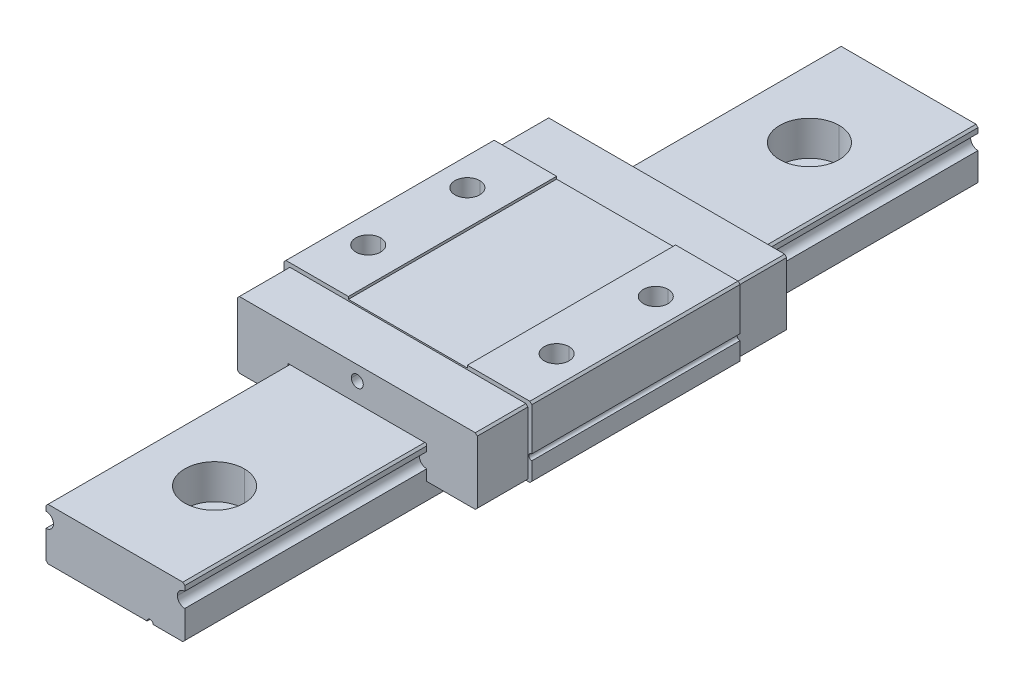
ISO-10303-21;
HEADER;
FILE_DESCRIPTION(('STEP AP214'),'2;1');
FILE_NAME('part.step','',(''),(''),'','','');
FILE_SCHEMA(('AUTOMOTIVE_DESIGN { 1 0 10303 214 1 1 1 1 }'));
ENDSEC;
DATA;
#1=APPLICATION_CONTEXT('core data for automotive mechanical design processes');
#2=APPLICATION_PROTOCOL_DEFINITION('international standard','automotive_design',2000,#1);
#3=PRODUCT_CONTEXT('',#1,'mechanical');
#4=PRODUCT('Part','Part','',(#3));
#5=PRODUCT_RELATED_PRODUCT_CATEGORY('part','',(#4));
#6=PRODUCT_DEFINITION_FORMATION('','',#4);
#7=PRODUCT_DEFINITION_CONTEXT('part definition',#1,'design');
#8=PRODUCT_DEFINITION('design','',#6,#7);
#9=PRODUCT_DEFINITION_SHAPE('','',#8);
#10=(LENGTH_UNIT() NAMED_UNIT(*) SI_UNIT(.MILLI.,.METRE.));
#11=(NAMED_UNIT(*) PLANE_ANGLE_UNIT() SI_UNIT($,.RADIAN.));
#12=(NAMED_UNIT(*) SI_UNIT($,.STERADIAN.) SOLID_ANGLE_UNIT());
#13=UNCERTAINTY_MEASURE_WITH_UNIT(LENGTH_MEASURE(1.E-05),#10,'distance_accuracy_value','');
#14=(GEOMETRIC_REPRESENTATION_CONTEXT(3) GLOBAL_UNCERTAINTY_ASSIGNED_CONTEXT((#13)) GLOBAL_UNIT_ASSIGNED_CONTEXT((#10,
#11,#12)) REPRESENTATION_CONTEXT('',''));
#15=CARTESIAN_POINT('',(0.,0.,0.));
#16=DIRECTION('',(0.,0.,1.));
#17=DIRECTION('',(1.,0.,0.));
#18=AXIS2_PLACEMENT_3D('',#15,#16,#17);
#19=CARTESIAN_POINT('',(0.,5.2,-30.));
#20=DIRECTION('',(0.,-1.,0.));
#21=DIRECTION('',(0.,0.,-1.));
#22=AXIS2_PLACEMENT_3D('',#19,#20,#21);
#23=CYLINDRICAL_SURFACE('',#22,3.);
#24=CARTESIAN_POINT('',(0.,5.2,-30.));
#25=DIRECTION('',(0.,1.,0.));
#26=DIRECTION('',(0.,0.,-1.));
#27=AXIS2_PLACEMENT_3D('',#24,#25,#26);
#28=CIRCLE('',#27,3.);
#29=CARTESIAN_POINT('',(0.,5.2,-33.));
#30=VERTEX_POINT('',#29);
#31=CARTESIAN_POINT('',(0.,5.2,-27.));
#32=VERTEX_POINT('',#31);
#33=EDGE_CURVE('P0_E10',#30,#32,#28,.T.);
#34=ORIENTED_EDGE('',*,*,#33,.T.);
#35=DIRECTION('',(0.,-1.,0.));
#36=VECTOR('',#35,1.);
#37=CARTESIAN_POINT('',(0.,5.2,-27.));
#38=LINE('',#37,#36);
#39=CARTESIAN_POINT('',(0.,1.7,-27.));
#40=VERTEX_POINT('',#39);
#41=EDGE_CURVE('P0_E538',#32,#40,#38,.T.);
#42=ORIENTED_EDGE('',*,*,#41,.T.);
#43=CARTESIAN_POINT('',(0.,1.7,-30.));
#44=DIRECTION('',(0.,1.,0.));
#45=DIRECTION('',(0.,0.,-1.));
#46=AXIS2_PLACEMENT_3D('',#43,#44,#45);
#47=CIRCLE('',#46,3.);
#48=CARTESIAN_POINT('',(0.,1.7,-33.));
#49=VERTEX_POINT('',#48);
#50=EDGE_CURVE('P0_E496',#49,#40,#47,.T.);
#51=ORIENTED_EDGE('',*,*,#50,.F.);
#52=DIRECTION('',(0.,-1.,0.));
#53=VECTOR('',#52,1.);
#54=CARTESIAN_POINT('',(0.,5.2,-33.));
#55=LINE('',#54,#53);
#56=EDGE_CURVE('P0_E367',#30,#49,#55,.T.);
#57=ORIENTED_EDGE('',*,*,#56,.F.);
#58=EDGE_LOOP('',(#34,#42,#51,#57));
#59=FACE_BOUND('',#58,.T.);
#60=ADVANCED_FACE('P0_F16',(#59),#23,.F.);
#61=CARTESIAN_POINT('',(0.,5.2,0.));
#62=DIRECTION('',(0.,-1.,0.));
#63=DIRECTION('',(0.,0.,-1.));
#64=AXIS2_PLACEMENT_3D('',#61,#62,#63);
#65=CYLINDRICAL_SURFACE('',#64,3.);
#66=CARTESIAN_POINT('',(0.,5.2,0.));
#67=DIRECTION('',(0.,1.,0.));
#68=DIRECTION('',(0.,0.,-1.));
#69=AXIS2_PLACEMENT_3D('',#66,#67,#68);
#70=CIRCLE('',#69,3.);
#71=CARTESIAN_POINT('',(0.,5.2,-3.));
#72=VERTEX_POINT('',#71);
#73=CARTESIAN_POINT('',(0.,5.2,3.));
#74=VERTEX_POINT('',#73);
#75=EDGE_CURVE('P0_E24',#72,#74,#70,.T.);
#76=ORIENTED_EDGE('',*,*,#75,.T.);
#77=DIRECTION('',(0.,-1.,0.));
#78=VECTOR('',#77,1.);
#79=CARTESIAN_POINT('',(0.,5.2,3.));
#80=LINE('',#79,#78);
#81=CARTESIAN_POINT('',(0.,1.7,3.));
#82=VERTEX_POINT('',#81);
#83=EDGE_CURVE('P0_E343',#74,#82,#80,.T.);
#84=ORIENTED_EDGE('',*,*,#83,.T.);
#85=CARTESIAN_POINT('',(0.,1.7,0.));
#86=DIRECTION('',(0.,1.,0.));
#87=DIRECTION('',(0.,0.,-1.));
#88=AXIS2_PLACEMENT_3D('',#85,#86,#87);
#89=CIRCLE('',#88,3.);
#90=CARTESIAN_POINT('',(0.,1.7,-3.));
#91=VERTEX_POINT('',#90);
#92=EDGE_CURVE('P0_E308',#91,#82,#89,.T.);
#93=ORIENTED_EDGE('',*,*,#92,.F.);
#94=DIRECTION('',(0.,-1.,0.));
#95=VECTOR('',#94,1.);
#96=CARTESIAN_POINT('',(0.,5.2,-3.));
#97=LINE('',#96,#95);
#98=EDGE_CURVE('P0_E342',#72,#91,#97,.T.);
#99=ORIENTED_EDGE('',*,*,#98,.F.);
#100=EDGE_LOOP('',(#76,#84,#93,#99));
#101=FACE_BOUND('',#100,.T.);
#102=ADVANCED_FACE('P0_F550',(#101),#65,.F.);
#103=CARTESIAN_POINT('',(0.,5.2,30.));
#104=DIRECTION('',(0.,-1.,0.));
#105=DIRECTION('',(0.,0.,-1.));
#106=AXIS2_PLACEMENT_3D('',#103,#104,#105);
#107=CYLINDRICAL_SURFACE('',#106,3.);
#108=CARTESIAN_POINT('',(0.,5.2,30.));
#109=DIRECTION('',(0.,1.,0.));
#110=DIRECTION('',(0.,0.,-1.));
#111=AXIS2_PLACEMENT_3D('',#108,#109,#110);
#112=CIRCLE('',#111,3.);
#113=CARTESIAN_POINT('',(0.,5.2,27.));
#114=VERTEX_POINT('',#113);
#115=CARTESIAN_POINT('',(0.,5.2,33.));
#116=VERTEX_POINT('',#115);
#117=EDGE_CURVE('P0_E370',#114,#116,#112,.T.);
#118=ORIENTED_EDGE('',*,*,#117,.T.);
#119=DIRECTION('',(0.,-1.,0.));
#120=VECTOR('',#119,1.);
#121=CARTESIAN_POINT('',(0.,5.2,33.));
#122=LINE('',#121,#120);
#123=CARTESIAN_POINT('',(0.,1.7,33.));
#124=VERTEX_POINT('',#123);
#125=EDGE_CURVE('P0_E527',#116,#124,#122,.T.);
#126=ORIENTED_EDGE('',*,*,#125,.T.);
#127=CARTESIAN_POINT('',(0.,1.7,30.));
#128=DIRECTION('',(0.,1.,0.));
#129=DIRECTION('',(0.,0.,-1.));
#130=AXIS2_PLACEMENT_3D('',#127,#128,#129);
#131=CIRCLE('',#130,3.);
#132=CARTESIAN_POINT('',(0.,1.7,27.));
#133=VERTEX_POINT('',#132);
#134=EDGE_CURVE('P0_E395',#133,#124,#131,.T.);
#135=ORIENTED_EDGE('',*,*,#134,.F.);
#136=DIRECTION('',(0.,-1.,0.));
#137=VECTOR('',#136,1.);
#138=CARTESIAN_POINT('',(0.,5.2,27.));
#139=LINE('',#138,#137);
#140=EDGE_CURVE('P0_E459',#114,#133,#139,.T.);
#141=ORIENTED_EDGE('',*,*,#140,.F.);
#142=EDGE_LOOP('',(#118,#126,#135,#141));
#143=FACE_BOUND('',#142,.T.);
#144=ADVANCED_FACE('P0_F583',(#143),#107,.F.);
#145=CARTESIAN_POINT('',(0.,-11.2052225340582,-30.));
#146=DIRECTION('',(0.,-1.,0.));
#147=DIRECTION('',(0.,0.,-1.));
#148=AXIS2_PLACEMENT_3D('',#145,#146,#147);
#149=CYLINDRICAL_SURFACE('',#148,1.75);
#150=CARTESIAN_POINT('',(0.,1.7,-30.));
#151=DIRECTION('',(0.,1.,0.));
#152=DIRECTION('',(0.,0.,-1.));
#153=AXIS2_PLACEMENT_3D('',#150,#151,#152);
#154=CIRCLE('',#153,1.75);
#155=CARTESIAN_POINT('',(0.,1.7,-31.75));
#156=VERTEX_POINT('',#155);
#157=CARTESIAN_POINT('',(0.,1.7,-28.25));
#158=VERTEX_POINT('',#157);
#159=EDGE_CURVE('P0_E504',#156,#158,#154,.T.);
#160=ORIENTED_EDGE('',*,*,#159,.T.);
#161=DIRECTION('',(0.,-1.,0.));
#162=VECTOR('',#161,1.);
#163=CARTESIAN_POINT('',(0.,-11.2052225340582,-28.25));
#164=LINE('',#163,#162);
#165=CARTESIAN_POINT('',(0.,0.,-28.25));
#166=VERTEX_POINT('',#165);
#167=EDGE_CURVE('P0_E390',#158,#166,#164,.T.);
#168=ORIENTED_EDGE('',*,*,#167,.T.);
#169=CARTESIAN_POINT('',(0.,0.,-30.));
#170=DIRECTION('',(0.,-1.,0.));
#171=DIRECTION('',(0.,0.,-1.));
#172=AXIS2_PLACEMENT_3D('',#169,#170,#171);
#173=CIRCLE('',#172,1.75);
#174=CARTESIAN_POINT('',(0.,0.,-31.75));
#175=VERTEX_POINT('',#174);
#176=EDGE_CURVE('P0_E445',#166,#175,#173,.T.);
#177=ORIENTED_EDGE('',*,*,#176,.T.);
#178=DIRECTION('',(0.,-1.,0.));
#179=VECTOR('',#178,1.);
#180=CARTESIAN_POINT('',(0.,-11.2052225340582,-31.75));
#181=LINE('',#180,#179);
#182=EDGE_CURVE('P0_E403',#156,#175,#181,.T.);
#183=ORIENTED_EDGE('',*,*,#182,.F.);
#184=EDGE_LOOP('',(#160,#168,#177,#183));
#185=FACE_BOUND('',#184,.T.);
#186=ADVANCED_FACE('P0_F587',(#185),#149,.F.);
#187=CARTESIAN_POINT('',(0.,-11.2052225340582,0.));
#188=DIRECTION('',(0.,-1.,0.));
#189=DIRECTION('',(0.,0.,-1.));
#190=AXIS2_PLACEMENT_3D('',#187,#188,#189);
#191=CYLINDRICAL_SURFACE('',#190,1.75);
#192=CARTESIAN_POINT('',(0.,1.7,0.));
#193=DIRECTION('',(0.,1.,0.));
#194=DIRECTION('',(0.,0.,-1.));
#195=AXIS2_PLACEMENT_3D('',#192,#193,#194);
#196=CIRCLE('',#195,1.75);
#197=CARTESIAN_POINT('',(0.,1.7,-1.75));
#198=VERTEX_POINT('',#197);
#199=CARTESIAN_POINT('',(0.,1.7,1.75));
#200=VERTEX_POINT('',#199);
#201=EDGE_CURVE('P0_E493',#198,#200,#196,.T.);
#202=ORIENTED_EDGE('',*,*,#201,.T.);
#203=DIRECTION('',(0.,-1.,0.));
#204=VECTOR('',#203,1.);
#205=CARTESIAN_POINT('',(0.,-11.2052225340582,1.75));
#206=LINE('',#205,#204);
#207=CARTESIAN_POINT('',(0.,0.,1.75));
#208=VERTEX_POINT('',#207);
#209=EDGE_CURVE('P0_E326',#200,#208,#206,.T.);
#210=ORIENTED_EDGE('',*,*,#209,.T.);
#211=CARTESIAN_POINT('',(0.,0.,0.));
#212=DIRECTION('',(0.,-1.,0.));
#213=DIRECTION('',(0.,0.,-1.));
#214=AXIS2_PLACEMENT_3D('',#211,#212,#213);
#215=CIRCLE('',#214,1.75);
#216=CARTESIAN_POINT('',(0.,0.,-1.75));
#217=VERTEX_POINT('',#216);
#218=EDGE_CURVE('P0_E437',#208,#217,#215,.T.);
#219=ORIENTED_EDGE('',*,*,#218,.T.);
#220=DIRECTION('',(0.,-1.,0.));
#221=VECTOR('',#220,1.);
#222=CARTESIAN_POINT('',(0.,-11.2052225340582,-1.75));
#223=LINE('',#222,#221);
#224=EDGE_CURVE('P0_E382',#198,#217,#223,.T.);
#225=ORIENTED_EDGE('',*,*,#224,.F.);
#226=EDGE_LOOP('',(#202,#210,#219,#225));
#227=FACE_BOUND('',#226,.T.);
#228=ADVANCED_FACE('P0_F593',(#227),#191,.F.);
#229=CARTESIAN_POINT('',(0.,-11.2052225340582,30.));
#230=DIRECTION('',(0.,-1.,0.));
#231=DIRECTION('',(0.,0.,-1.));
#232=AXIS2_PLACEMENT_3D('',#229,#230,#231);
#233=CYLINDRICAL_SURFACE('',#232,1.75);
#234=CARTESIAN_POINT('',(0.,1.7,30.));
#235=DIRECTION('',(0.,1.,0.));
#236=DIRECTION('',(0.,0.,-1.));
#237=AXIS2_PLACEMENT_3D('',#234,#235,#236);
#238=CIRCLE('',#237,1.75);
#239=CARTESIAN_POINT('',(0.,1.7,28.25));
#240=VERTEX_POINT('',#239);
#241=CARTESIAN_POINT('',(0.,1.7,31.75));
#242=VERTEX_POINT('',#241);
#243=EDGE_CURVE('P0_E305',#240,#242,#238,.T.);
#244=ORIENTED_EDGE('',*,*,#243,.T.);
#245=DIRECTION('',(0.,-1.,0.));
#246=VECTOR('',#245,1.);
#247=CARTESIAN_POINT('',(0.,-11.2052225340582,31.75));
#248=LINE('',#247,#246);
#249=CARTESIAN_POINT('',(0.,0.,31.75));
#250=VERTEX_POINT('',#249);
#251=EDGE_CURVE('P0_E359',#242,#250,#248,.T.);
#252=ORIENTED_EDGE('',*,*,#251,.T.);
#253=CARTESIAN_POINT('',(0.,0.,30.));
#254=DIRECTION('',(0.,-1.,0.));
#255=DIRECTION('',(0.,0.,-1.));
#256=AXIS2_PLACEMENT_3D('',#253,#254,#255);
#257=CIRCLE('',#256,1.75);
#258=CARTESIAN_POINT('',(0.,0.,28.25));
#259=VERTEX_POINT('',#258);
#260=EDGE_CURVE('P0_E434',#250,#259,#257,.T.);
#261=ORIENTED_EDGE('',*,*,#260,.T.);
#262=DIRECTION('',(0.,-1.,0.));
#263=VECTOR('',#262,1.);
#264=CARTESIAN_POINT('',(0.,-11.2052225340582,28.25));
#265=LINE('',#264,#263);
#266=EDGE_CURVE('P0_E327',#240,#259,#265,.T.);
#267=ORIENTED_EDGE('',*,*,#266,.F.);
#268=EDGE_LOOP('',(#244,#252,#261,#267));
#269=FACE_BOUND('',#268,.T.);
#270=ADVANCED_FACE('P0_F597',(#269),#233,.F.);
#271=CARTESIAN_POINT('',(7.,3.75,40.));
#272=DIRECTION('',(0.,0.,-1.));
#273=DIRECTION('',(-1.,0.,0.));
#274=AXIS2_PLACEMENT_3D('',#271,#272,#273);
#275=CYLINDRICAL_SURFACE('',#274,0.75);
#276=CARTESIAN_POINT('',(7.,3.75,40.));
#277=DIRECTION('',(0.,0.,-1.));
#278=DIRECTION('',(-1.,0.,0.));
#279=AXIS2_PLACEMENT_3D('',#276,#277,#278);
#280=CIRCLE('',#279,0.75);
#281=CARTESIAN_POINT('',(6.25,3.75,40.));
#282=VERTEX_POINT('',#281);
#283=CARTESIAN_POINT('',(7.,4.5,40.));
#284=VERTEX_POINT('',#283);
#285=EDGE_CURVE('P0_E507',#282,#284,#280,.T.);
#286=ORIENTED_EDGE('',*,*,#285,.F.);
#287=DIRECTION('',(0.,0.,-1.));
#288=VECTOR('',#287,1.);
#289=CARTESIAN_POINT('',(6.25,3.75,40.));
#290=LINE('',#289,#288);
#291=CARTESIAN_POINT('',(6.25,3.75,-40.));
#292=VERTEX_POINT('',#291);
#293=EDGE_CURVE('P0_E337',#282,#292,#290,.T.);
#294=ORIENTED_EDGE('',*,*,#293,.T.);
#295=CARTESIAN_POINT('',(7.,3.75,-40.));
#296=DIRECTION('',(0.,0.,1.));
#297=DIRECTION('',(-1.,0.,0.));
#298=AXIS2_PLACEMENT_3D('',#295,#296,#297);
#299=CIRCLE('',#298,0.75);
#300=CARTESIAN_POINT('',(7.,4.5,-40.));
#301=VERTEX_POINT('',#300);
#302=EDGE_CURVE('P0_E465',#301,#292,#299,.T.);
#303=ORIENTED_EDGE('',*,*,#302,.F.);
#304=DIRECTION('',(0.,0.,1.));
#305=VECTOR('',#304,1.);
#306=CARTESIAN_POINT('',(7.,4.5,40.));
#307=LINE('',#306,#305);
#308=EDGE_CURVE('P0_E399',#301,#284,#307,.T.);
#309=ORIENTED_EDGE('',*,*,#308,.T.);
#310=EDGE_LOOP('',(#286,#294,#303,#309));
#311=FACE_BOUND('',#310,.T.);
#312=ADVANCED_FACE('P0_F601',(#311),#275,.F.);
#313=CARTESIAN_POINT('',(7.,5.2,40.));
#314=DIRECTION('',(0.,-1.,0.));
#315=DIRECTION('',(0.,0.,-1.));
#316=AXIS2_PLACEMENT_3D('',#313,#314,#315);
#317=PLANE('',#316);
#318=ORIENTED_EDGE('',*,*,#33,.F.);
#319=CARTESIAN_POINT('',(0.,5.2,-30.));
#320=DIRECTION('',(0.,1.,0.));
#321=DIRECTION('',(0.,0.,-1.));
#322=AXIS2_PLACEMENT_3D('',#319,#320,#321);
#323=CIRCLE('',#322,3.);
#324=EDGE_CURVE('P0_E371',#32,#30,#323,.T.);
#325=ORIENTED_EDGE('',*,*,#324,.F.);
#326=EDGE_LOOP('',(#318,#325));
#327=FACE_BOUND('',#326,.T.);
#328=ORIENTED_EDGE('',*,*,#75,.F.);
#329=CARTESIAN_POINT('',(0.,5.2,0.));
#330=DIRECTION('',(0.,1.,0.));
#331=DIRECTION('',(0.,0.,-1.));
#332=AXIS2_PLACEMENT_3D('',#329,#330,#331);
#333=CIRCLE('',#332,3.);
#334=EDGE_CURVE('P0_E338',#74,#72,#333,.T.);
#335=ORIENTED_EDGE('',*,*,#334,.F.);
#336=EDGE_LOOP('',(#328,#335));
#337=FACE_BOUND('',#336,.T.);
#338=ORIENTED_EDGE('',*,*,#117,.F.);
#339=CARTESIAN_POINT('',(0.,5.2,30.));
#340=DIRECTION('',(0.,1.,0.));
#341=DIRECTION('',(0.,0.,-1.));
#342=AXIS2_PLACEMENT_3D('',#339,#340,#341);
#343=CIRCLE('',#342,3.);
#344=EDGE_CURVE('P0_E530',#116,#114,#343,.T.);
#345=ORIENTED_EDGE('',*,*,#344,.F.);
#346=EDGE_LOOP('',(#338,#345));
#347=FACE_BOUND('',#346,.T.);
#348=DIRECTION('',(1.,0.,0.));
#349=VECTOR('',#348,1.);
#350=CARTESIAN_POINT('',(7.,5.2,-40.));
#351=LINE('',#350,#349);
#352=CARTESIAN_POINT('',(-6.8,5.2,-40.));
#353=VERTEX_POINT('',#352);
#354=CARTESIAN_POINT('',(6.8,5.2,-40.));
#355=VERTEX_POINT('',#354);
#356=EDGE_CURVE('P0_E316',#353,#355,#351,.T.);
#357=ORIENTED_EDGE('',*,*,#356,.F.);
#358=DIRECTION('',(0.,0.,-1.));
#359=VECTOR('',#358,1.);
#360=CARTESIAN_POINT('',(-6.8,5.2,40.));
#361=LINE('',#360,#359);
#362=CARTESIAN_POINT('',(-6.8,5.2,40.));
#363=VERTEX_POINT('',#362);
#364=EDGE_CURVE('P0_E515',#363,#353,#361,.T.);
#365=ORIENTED_EDGE('',*,*,#364,.F.);
#366=DIRECTION('',(-1.,0.,0.));
#367=VECTOR('',#366,1.);
#368=CARTESIAN_POINT('',(7.,5.2,40.));
#369=LINE('',#368,#367);
#370=CARTESIAN_POINT('',(6.8,5.2,40.));
#371=VERTEX_POINT('',#370);
#372=EDGE_CURVE('P0_E297',#371,#363,#369,.T.);
#373=ORIENTED_EDGE('',*,*,#372,.F.);
#374=DIRECTION('',(0.,0.,1.));
#375=VECTOR('',#374,1.);
#376=CARTESIAN_POINT('',(6.8,5.2,40.));
#377=LINE('',#376,#375);
#378=EDGE_CURVE('P0_E524',#355,#371,#377,.T.);
#379=ORIENTED_EDGE('',*,*,#378,.F.);
#380=EDGE_LOOP('',(#357,#365,#373,#379));
#381=FACE_BOUND('',#380,.T.);
#382=ADVANCED_FACE('P0_F555',(#327,#337,#347,#381),#317,.F.);
#383=CARTESIAN_POINT('',(0.,5.2,-30.));
#384=DIRECTION('',(0.,-1.,0.));
#385=DIRECTION('',(0.,0.,-1.));
#386=AXIS2_PLACEMENT_3D('',#383,#384,#385);
#387=CYLINDRICAL_SURFACE('',#386,3.);
#388=ORIENTED_EDGE('',*,*,#41,.F.);
#389=ORIENTED_EDGE('',*,*,#324,.T.);
#390=ORIENTED_EDGE('',*,*,#56,.T.);
#391=CARTESIAN_POINT('',(0.,1.7,-30.));
#392=DIRECTION('',(0.,1.,0.));
#393=DIRECTION('',(0.,0.,-1.));
#394=AXIS2_PLACEMENT_3D('',#391,#392,#393);
#395=CIRCLE('',#394,3.);
#396=EDGE_CURVE('P0_E500',#40,#49,#395,.T.);
#397=ORIENTED_EDGE('',*,*,#396,.F.);
#398=EDGE_LOOP('',(#388,#389,#390,#397));
#399=FACE_BOUND('',#398,.T.);
#400=ADVANCED_FACE('P0_F608',(#399),#387,.F.);
#401=CARTESIAN_POINT('',(0.,5.2,0.));
#402=DIRECTION('',(0.,-1.,0.));
#403=DIRECTION('',(0.,0.,-1.));
#404=AXIS2_PLACEMENT_3D('',#401,#402,#403);
#405=CYLINDRICAL_SURFACE('',#404,3.);
#406=ORIENTED_EDGE('',*,*,#83,.F.);
#407=ORIENTED_EDGE('',*,*,#334,.T.);
#408=ORIENTED_EDGE('',*,*,#98,.T.);
#409=CARTESIAN_POINT('',(0.,1.7,0.));
#410=DIRECTION('',(0.,1.,0.));
#411=DIRECTION('',(0.,0.,-1.));
#412=AXIS2_PLACEMENT_3D('',#409,#410,#411);
#413=CIRCLE('',#412,3.);
#414=EDGE_CURVE('P0_E489',#82,#91,#413,.T.);
#415=ORIENTED_EDGE('',*,*,#414,.F.);
#416=EDGE_LOOP('',(#406,#407,#408,#415));
#417=FACE_BOUND('',#416,.T.);
#418=ADVANCED_FACE('P0_F558',(#417),#405,.F.);
#419=CARTESIAN_POINT('',(0.,5.2,30.));
#420=DIRECTION('',(0.,-1.,0.));
#421=DIRECTION('',(0.,0.,-1.));
#422=AXIS2_PLACEMENT_3D('',#419,#420,#421);
#423=CYLINDRICAL_SURFACE('',#422,3.);
#424=ORIENTED_EDGE('',*,*,#125,.F.);
#425=ORIENTED_EDGE('',*,*,#344,.T.);
#426=ORIENTED_EDGE('',*,*,#140,.T.);
#427=CARTESIAN_POINT('',(0.,1.7,30.));
#428=DIRECTION('',(0.,1.,0.));
#429=DIRECTION('',(0.,0.,-1.));
#430=AXIS2_PLACEMENT_3D('',#427,#428,#429);
#431=CIRCLE('',#430,3.);
#432=EDGE_CURVE('P0_E309',#124,#133,#431,.T.);
#433=ORIENTED_EDGE('',*,*,#432,.F.);
#434=EDGE_LOOP('',(#424,#425,#426,#433));
#435=FACE_BOUND('',#434,.T.);
#436=ADVANCED_FACE('P0_F614',(#435),#423,.F.);
#437=CARTESIAN_POINT('',(6.8,5.2,40.));
#438=DIRECTION('',(-0.707106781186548,-0.707106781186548,0.));
#439=DIRECTION('',(-0.707106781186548,0.707106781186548,0.));
#440=AXIS2_PLACEMENT_3D('',#437,#438,#439);
#441=PLANE('',#440);
#442=DIRECTION('',(-0.707106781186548,0.707106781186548,0.));
#443=VECTOR('',#442,1.);
#444=CARTESIAN_POINT('',(6.8,5.2,40.));
#445=LINE('',#444,#443);
#446=CARTESIAN_POINT('',(7.,5.,40.));
#447=VERTEX_POINT('',#446);
#448=EDGE_CURVE('P0_E302',#447,#371,#445,.T.);
#449=ORIENTED_EDGE('',*,*,#448,.F.);
#450=DIRECTION('',(0.,0.,1.));
#451=VECTOR('',#450,1.);
#452=CARTESIAN_POINT('',(7.,5.,40.));
#453=LINE('',#452,#451);
#454=CARTESIAN_POINT('',(7.,5.,-40.));
#455=VERTEX_POINT('',#454);
#456=EDGE_CURVE('P0_E475',#455,#447,#453,.T.);
#457=ORIENTED_EDGE('',*,*,#456,.F.);
#458=DIRECTION('',(0.707106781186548,-0.707106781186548,0.));
#459=VECTOR('',#458,1.);
#460=CARTESIAN_POINT('',(6.8,5.2,-40.));
#461=LINE('',#460,#459);
#462=EDGE_CURVE('P0_E320',#355,#455,#461,.T.);
#463=ORIENTED_EDGE('',*,*,#462,.F.);
#464=ORIENTED_EDGE('',*,*,#378,.T.);
#465=EDGE_LOOP('',(#449,#457,#463,#464));
#466=FACE_BOUND('',#465,.T.);
#467=ADVANCED_FACE('P0_F615',(#466),#441,.F.);
#468=CARTESIAN_POINT('',(3.5,0.,-40.));
#469=DIRECTION('',(0.,0.,-1.));
#470=DIRECTION('',(0.,-1.,0.));
#471=AXIS2_PLACEMENT_3D('',#468,#469,#470);
#472=PLANE('',#471);
#473=DIRECTION('',(0.,-1.,0.));
#474=VECTOR('',#473,1.);
#475=CARTESIAN_POINT('',(7.,0.,-40.));
#476=LINE('',#475,#474);
#477=CARTESIAN_POINT('',(7.,3.,-40.));
#478=VERTEX_POINT('',#477);
#479=CARTESIAN_POINT('',(7.,0.2,-40.));
#480=VERTEX_POINT('',#479);
#481=EDGE_CURVE('P0_E470',#478,#480,#476,.T.);
#482=ORIENTED_EDGE('',*,*,#481,.T.);
#483=DIRECTION('',(-0.707106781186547,-0.707106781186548,0.));
#484=VECTOR('',#483,1.);
#485=CARTESIAN_POINT('',(7.,0.2,-40.));
#486=LINE('',#485,#484);
#487=CARTESIAN_POINT('',(6.8,0.,-40.));
#488=VERTEX_POINT('',#487);
#489=EDGE_CURVE('P0_E259',#480,#488,#486,.T.);
#490=ORIENTED_EDGE('',*,*,#489,.T.);
#491=DIRECTION('',(-1.,0.,0.));
#492=VECTOR('',#491,1.);
#493=CARTESIAN_POINT('',(3.5,0.,-40.));
#494=LINE('',#493,#492);
#495=CARTESIAN_POINT('',(3.8,0.,-40.));
#496=VERTEX_POINT('',#495);
#497=EDGE_CURVE('P0_E253',#488,#496,#494,.T.);
#498=ORIENTED_EDGE('',*,*,#497,.T.);
#499=CARTESIAN_POINT('',(3.5,0.,-40.));
#500=DIRECTION('',(0.,0.,1.));
#501=DIRECTION('',(-1.,0.,0.));
#502=AXIS2_PLACEMENT_3D('',#499,#500,#501);
#503=CIRCLE('',#502,0.3);
#504=CARTESIAN_POINT('',(3.2,0.,-40.));
#505=VERTEX_POINT('',#504);
#506=EDGE_CURVE('P0_E257',#496,#505,#503,.T.);
#507=ORIENTED_EDGE('',*,*,#506,.T.);
#508=DIRECTION('',(-1.,0.,0.));
#509=VECTOR('',#508,1.);
#510=CARTESIAN_POINT('',(3.5,0.,-40.));
#511=LINE('',#510,#509);
#512=CARTESIAN_POINT('',(-6.8,0.,-40.));
#513=VERTEX_POINT('',#512);
#514=EDGE_CURVE('P0_E415',#505,#513,#511,.T.);
#515=ORIENTED_EDGE('',*,*,#514,.T.);
#516=DIRECTION('',(-0.707106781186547,0.707106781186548,0.));
#517=VECTOR('',#516,1.);
#518=CARTESIAN_POINT('',(-6.8,0.,-40.));
#519=LINE('',#518,#517);
#520=CARTESIAN_POINT('',(-7.,0.2,-40.));
#521=VERTEX_POINT('',#520);
#522=EDGE_CURVE('P0_E292',#513,#521,#519,.T.);
#523=ORIENTED_EDGE('',*,*,#522,.T.);
#524=DIRECTION('',(0.,1.,0.));
#525=VECTOR('',#524,1.);
#526=CARTESIAN_POINT('',(-7.,0.,-40.));
#527=LINE('',#526,#525);
#528=CARTESIAN_POINT('',(-7.,3.,-40.));
#529=VERTEX_POINT('',#528);
#530=EDGE_CURVE('P0_E448',#521,#529,#527,.T.);
#531=ORIENTED_EDGE('',*,*,#530,.T.);
#532=CARTESIAN_POINT('',(-7.,3.75,-40.));
#533=DIRECTION('',(0.,0.,1.));
#534=DIRECTION('',(-1.,0.,0.));
#535=AXIS2_PLACEMENT_3D('',#532,#533,#534);
#536=CIRCLE('',#535,0.75);
#537=CARTESIAN_POINT('',(-7.,4.5,-40.));
#538=VERTEX_POINT('',#537);
#539=EDGE_CURVE('P0_E442',#529,#538,#536,.T.);
#540=ORIENTED_EDGE('',*,*,#539,.T.);
#541=DIRECTION('',(0.,1.,0.));
#542=VECTOR('',#541,1.);
#543=CARTESIAN_POINT('',(-7.,5.2,-40.));
#544=LINE('',#543,#542);
#545=CARTESIAN_POINT('',(-7.,5.,-40.));
#546=VERTEX_POINT('',#545);
#547=EDGE_CURVE('P0_E423',#538,#546,#544,.T.);
#548=ORIENTED_EDGE('',*,*,#547,.T.);
#549=DIRECTION('',(0.707106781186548,0.707106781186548,0.));
#550=VECTOR('',#549,1.);
#551=CARTESIAN_POINT('',(-7.,5.,-40.));
#552=LINE('',#551,#550);
#553=EDGE_CURVE('P0_E321',#546,#353,#552,.T.);
#554=ORIENTED_EDGE('',*,*,#553,.T.);
#555=ORIENTED_EDGE('',*,*,#356,.T.);
#556=ORIENTED_EDGE('',*,*,#462,.T.);
#557=DIRECTION('',(0.,-1.,0.));
#558=VECTOR('',#557,1.);
#559=CARTESIAN_POINT('',(7.,0.,-40.));
#560=LINE('',#559,#558);
#561=EDGE_CURVE('P0_E471',#455,#301,#560,.T.);
#562=ORIENTED_EDGE('',*,*,#561,.T.);
#563=ORIENTED_EDGE('',*,*,#302,.T.);
#564=CARTESIAN_POINT('',(7.,3.75,-40.));
#565=DIRECTION('',(0.,0.,1.));
#566=DIRECTION('',(-1.,0.,0.));
#567=AXIS2_PLACEMENT_3D('',#564,#565,#566);
#568=CIRCLE('',#567,0.75);
#569=EDGE_CURVE('P0_E314',#292,#478,#568,.T.);
#570=ORIENTED_EDGE('',*,*,#569,.T.);
#571=EDGE_LOOP('',(#482,#490,#498,#507,#515,#523,#531,#540,#548,#554,#555,#556,#562,#563,#570));
#572=FACE_BOUND('',#571,.T.);
#573=ADVANCED_FACE('P0_F255',(#572),#472,.T.);
#574=CARTESIAN_POINT('',(-7.,5.,40.));
#575=DIRECTION('',(0.707106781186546,-0.707106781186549,0.));
#576=DIRECTION('',(0.,0.,-1.));
#577=AXIS2_PLACEMENT_3D('',#574,#575,#576);
#578=PLANE('',#577);
#579=DIRECTION('',(-0.707106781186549,-0.707106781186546,0.));
#580=VECTOR('',#579,1.);
#581=CARTESIAN_POINT('',(-7.,5.,40.));
#582=LINE('',#581,#580);
#583=CARTESIAN_POINT('',(-7.,5.,40.));
#584=VERTEX_POINT('',#583);
#585=EDGE_CURVE('P0_E301',#363,#584,#582,.T.);
#586=ORIENTED_EDGE('',*,*,#585,.F.);
#587=ORIENTED_EDGE('',*,*,#364,.T.);
#588=ORIENTED_EDGE('',*,*,#553,.F.);
#589=DIRECTION('',(0.,0.,-1.));
#590=VECTOR('',#589,1.);
#591=CARTESIAN_POINT('',(-7.,5.,40.));
#592=LINE('',#591,#590);
#593=EDGE_CURVE('P0_E418',#584,#546,#592,.T.);
#594=ORIENTED_EDGE('',*,*,#593,.F.);
#595=EDGE_LOOP('',(#586,#587,#588,#594));
#596=FACE_BOUND('',#595,.T.);
#597=ADVANCED_FACE('P0_F620',(#596),#578,.F.);
#598=CARTESIAN_POINT('',(3.5,0.,40.));
#599=DIRECTION('',(0.,0.,-1.));
#600=DIRECTION('',(0.,-1.,0.));
#601=AXIS2_PLACEMENT_3D('',#598,#599,#600);
#602=PLANE('',#601);
#603=DIRECTION('',(0.,1.,0.));
#604=VECTOR('',#603,1.);
#605=CARTESIAN_POINT('',(-7.,0.,40.));
#606=LINE('',#605,#604);
#607=CARTESIAN_POINT('',(-7.,0.2,40.));
#608=VERTEX_POINT('',#607);
#609=CARTESIAN_POINT('',(-7.,3.,40.));
#610=VERTEX_POINT('',#609);
#611=EDGE_CURVE('P0_E452',#608,#610,#606,.T.);
#612=ORIENTED_EDGE('',*,*,#611,.F.);
#613=DIRECTION('',(0.707106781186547,-0.707106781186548,0.));
#614=VECTOR('',#613,1.);
#615=CARTESIAN_POINT('',(-6.8,0.,40.));
#616=LINE('',#615,#614);
#617=CARTESIAN_POINT('',(-6.8,0.,40.));
#618=VERTEX_POINT('',#617);
#619=EDGE_CURVE('P0_E333',#608,#618,#616,.T.);
#620=ORIENTED_EDGE('',*,*,#619,.T.);
#621=DIRECTION('',(-1.,0.,0.));
#622=VECTOR('',#621,1.);
#623=CARTESIAN_POINT('',(3.5,0.,40.));
#624=LINE('',#623,#622);
#625=CARTESIAN_POINT('',(3.2,0.,40.));
#626=VERTEX_POINT('',#625);
#627=EDGE_CURVE('P0_E412',#626,#618,#624,.T.);
#628=ORIENTED_EDGE('',*,*,#627,.F.);
#629=CARTESIAN_POINT('',(3.5,0.,40.));
#630=DIRECTION('',(0.,0.,-1.));
#631=DIRECTION('',(-1.,0.,0.));
#632=AXIS2_PLACEMENT_3D('',#629,#630,#631);
#633=CIRCLE('',#632,0.3);
#634=CARTESIAN_POINT('',(3.8,0.,40.));
#635=VERTEX_POINT('',#634);
#636=EDGE_CURVE('P0_E274',#626,#635,#633,.T.);
#637=ORIENTED_EDGE('',*,*,#636,.T.);
#638=DIRECTION('',(-1.,0.,0.));
#639=VECTOR('',#638,1.);
#640=CARTESIAN_POINT('',(3.5,0.,40.));
#641=LINE('',#640,#639);
#642=CARTESIAN_POINT('',(6.8,0.,40.));
#643=VERTEX_POINT('',#642);
#644=EDGE_CURVE('P0_E264',#643,#635,#641,.T.);
#645=ORIENTED_EDGE('',*,*,#644,.F.);
#646=DIRECTION('',(0.707106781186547,0.707106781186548,0.));
#647=VECTOR('',#646,1.);
#648=CARTESIAN_POINT('',(7.,0.2,40.));
#649=LINE('',#648,#647);
#650=CARTESIAN_POINT('',(7.,0.2,40.));
#651=VERTEX_POINT('',#650);
#652=EDGE_CURVE('P0_E330',#643,#651,#649,.T.);
#653=ORIENTED_EDGE('',*,*,#652,.T.);
#654=DIRECTION('',(0.,-1.,0.));
#655=VECTOR('',#654,1.);
#656=CARTESIAN_POINT('',(7.,0.,40.));
#657=LINE('',#656,#655);
#658=CARTESIAN_POINT('',(7.,3.,40.));
#659=VERTEX_POINT('',#658);
#660=EDGE_CURVE('P0_E441',#659,#651,#657,.T.);
#661=ORIENTED_EDGE('',*,*,#660,.F.);
#662=CARTESIAN_POINT('',(7.,3.75,40.));
#663=DIRECTION('',(0.,0.,-1.));
#664=DIRECTION('',(-1.,0.,0.));
#665=AXIS2_PLACEMENT_3D('',#662,#663,#664);
#666=CIRCLE('',#665,0.75);
#667=EDGE_CURVE('P0_E315',#659,#282,#666,.T.);
#668=ORIENTED_EDGE('',*,*,#667,.T.);
#669=ORIENTED_EDGE('',*,*,#285,.T.);
#670=DIRECTION('',(0.,-1.,0.));
#671=VECTOR('',#670,1.);
#672=CARTESIAN_POINT('',(7.,0.,40.));
#673=LINE('',#672,#671);
#674=EDGE_CURVE('P0_E479',#447,#284,#673,.T.);
#675=ORIENTED_EDGE('',*,*,#674,.F.);
#676=ORIENTED_EDGE('',*,*,#448,.T.);
#677=ORIENTED_EDGE('',*,*,#372,.T.);
#678=ORIENTED_EDGE('',*,*,#585,.T.);
#679=DIRECTION('',(0.,1.,0.));
#680=VECTOR('',#679,1.);
#681=CARTESIAN_POINT('',(-7.,0.,40.));
#682=LINE('',#681,#680);
#683=CARTESIAN_POINT('',(-7.,4.5,40.));
#684=VERTEX_POINT('',#683);
#685=EDGE_CURVE('P0_E411',#684,#584,#682,.T.);
#686=ORIENTED_EDGE('',*,*,#685,.F.);
#687=CARTESIAN_POINT('',(-7.,3.75,40.));
#688=DIRECTION('',(0.,0.,1.));
#689=DIRECTION('',(-1.,0.,0.));
#690=AXIS2_PLACEMENT_3D('',#687,#688,#689);
#691=CIRCLE('',#690,0.75);
#692=EDGE_CURVE('P0_E438',#610,#684,#691,.T.);
#693=ORIENTED_EDGE('',*,*,#692,.F.);
#694=EDGE_LOOP('',(#612,#620,#628,#637,#645,#653,#661,#668,#669,#675,#676,#677,#678,#686,#693));
#695=FACE_BOUND('',#694,.T.);
#696=ADVANCED_FACE('P0_F574',(#695),#602,.F.);
#697=CARTESIAN_POINT('',(0.,1.7,-30.));
#698=DIRECTION('',(0.,-1.,0.));
#699=DIRECTION('',(0.,0.,-1.));
#700=AXIS2_PLACEMENT_3D('',#697,#698,#699);
#701=PLANE('',#700);
#702=ORIENTED_EDGE('',*,*,#159,.F.);
#703=CARTESIAN_POINT('',(0.,1.7,-30.));
#704=DIRECTION('',(0.,1.,0.));
#705=DIRECTION('',(0.,0.,-1.));
#706=AXIS2_PLACEMENT_3D('',#703,#704,#705);
#707=CIRCLE('',#706,1.75);
#708=EDGE_CURVE('P0_E394',#158,#156,#707,.T.);
#709=ORIENTED_EDGE('',*,*,#708,.F.);
#710=EDGE_LOOP('',(#702,#709));
#711=FACE_BOUND('',#710,.T.);
#712=ORIENTED_EDGE('',*,*,#50,.T.);
#713=ORIENTED_EDGE('',*,*,#396,.T.);
#714=EDGE_LOOP('',(#712,#713));
#715=FACE_BOUND('',#714,.T.);
#716=ADVANCED_FACE('P0_F563',(#711,#715),#701,.F.);
#717=CARTESIAN_POINT('',(0.,1.7,0.));
#718=DIRECTION('',(0.,-1.,0.));
#719=DIRECTION('',(0.,0.,-1.));
#720=AXIS2_PLACEMENT_3D('',#717,#718,#719);
#721=PLANE('',#720);
#722=ORIENTED_EDGE('',*,*,#201,.F.);
#723=CARTESIAN_POINT('',(0.,1.7,0.));
#724=DIRECTION('',(0.,1.,0.));
#725=DIRECTION('',(0.,0.,-1.));
#726=AXIS2_PLACEMENT_3D('',#723,#724,#725);
#727=CIRCLE('',#726,1.75);
#728=EDGE_CURVE('P0_E378',#200,#198,#727,.T.);
#729=ORIENTED_EDGE('',*,*,#728,.F.);
#730=EDGE_LOOP('',(#722,#729));
#731=FACE_BOUND('',#730,.T.);
#732=ORIENTED_EDGE('',*,*,#92,.T.);
#733=ORIENTED_EDGE('',*,*,#414,.T.);
#734=EDGE_LOOP('',(#732,#733));
#735=FACE_BOUND('',#734,.T.);
#736=ADVANCED_FACE('P0_F560',(#731,#735),#721,.F.);
#737=CARTESIAN_POINT('',(0.,1.7,30.));
#738=DIRECTION('',(0.,-1.,0.));
#739=DIRECTION('',(0.,0.,-1.));
#740=AXIS2_PLACEMENT_3D('',#737,#738,#739);
#741=PLANE('',#740);
#742=ORIENTED_EDGE('',*,*,#243,.F.);
#743=CARTESIAN_POINT('',(0.,1.7,30.));
#744=DIRECTION('',(0.,1.,0.));
#745=DIRECTION('',(0.,0.,-1.));
#746=AXIS2_PLACEMENT_3D('',#743,#744,#745);
#747=CIRCLE('',#746,1.75);
#748=EDGE_CURVE('P0_E363',#242,#240,#747,.T.);
#749=ORIENTED_EDGE('',*,*,#748,.F.);
#750=EDGE_LOOP('',(#742,#749));
#751=FACE_BOUND('',#750,.T.);
#752=ORIENTED_EDGE('',*,*,#134,.T.);
#753=ORIENTED_EDGE('',*,*,#432,.T.);
#754=EDGE_LOOP('',(#752,#753));
#755=FACE_BOUND('',#754,.T.);
#756=ADVANCED_FACE('P0_F562',(#751,#755),#741,.F.);
#757=CARTESIAN_POINT('',(7.,4.5,40.));
#758=DIRECTION('',(-1.,0.,0.));
#759=DIRECTION('',(0.,1.,0.));
#760=AXIS2_PLACEMENT_3D('',#757,#758,#759);
#761=PLANE('',#760);
#762=ORIENTED_EDGE('',*,*,#561,.F.);
#763=ORIENTED_EDGE('',*,*,#456,.T.);
#764=ORIENTED_EDGE('',*,*,#674,.T.);
#765=ORIENTED_EDGE('',*,*,#308,.F.);
#766=EDGE_LOOP('',(#762,#763,#764,#765));
#767=FACE_BOUND('',#766,.T.);
#768=ADVANCED_FACE('P0_F571',(#767),#761,.F.);
#769=CARTESIAN_POINT('',(7.,0.,40.));
#770=DIRECTION('',(-1.,0.,0.));
#771=DIRECTION('',(0.,0.,1.));
#772=AXIS2_PLACEMENT_3D('',#769,#770,#771);
#773=PLANE('',#772);
#774=ORIENTED_EDGE('',*,*,#660,.T.);
#775=DIRECTION('',(0.,0.,1.));
#776=VECTOR('',#775,1.);
#777=CARTESIAN_POINT('',(7.,0.2,40.));
#778=LINE('',#777,#776);
#779=EDGE_CURVE('P0_E290',#480,#651,#778,.T.);
#780=ORIENTED_EDGE('',*,*,#779,.F.);
#781=ORIENTED_EDGE('',*,*,#481,.F.);
#782=DIRECTION('',(0.,0.,-1.));
#783=VECTOR('',#782,1.);
#784=CARTESIAN_POINT('',(7.,3.,40.));
#785=LINE('',#784,#783);
#786=EDGE_CURVE('P0_E310',#659,#478,#785,.T.);
#787=ORIENTED_EDGE('',*,*,#786,.F.);
#788=EDGE_LOOP('',(#774,#780,#781,#787));
#789=FACE_BOUND('',#788,.T.);
#790=ADVANCED_FACE('P0_F627',(#789),#773,.F.);
#791=CARTESIAN_POINT('',(-7.,3.75,40.));
#792=DIRECTION('',(0.,0.,-1.));
#793=DIRECTION('',(-1.,0.,0.));
#794=AXIS2_PLACEMENT_3D('',#791,#792,#793);
#795=CYLINDRICAL_SURFACE('',#794,0.75);
#796=ORIENTED_EDGE('',*,*,#539,.F.);
#797=DIRECTION('',(0.,0.,-1.));
#798=VECTOR('',#797,1.);
#799=CARTESIAN_POINT('',(-7.,3.,40.));
#800=LINE('',#799,#798);
#801=EDGE_CURVE('P0_E456',#610,#529,#800,.T.);
#802=ORIENTED_EDGE('',*,*,#801,.F.);
#803=ORIENTED_EDGE('',*,*,#692,.T.);
#804=DIRECTION('',(0.,0.,1.));
#805=VECTOR('',#804,1.);
#806=CARTESIAN_POINT('',(-7.,4.5,40.));
#807=LINE('',#806,#805);
#808=EDGE_CURVE('P0_E265',#538,#684,#807,.T.);
#809=ORIENTED_EDGE('',*,*,#808,.F.);
#810=EDGE_LOOP('',(#796,#802,#803,#809));
#811=FACE_BOUND('',#810,.T.);
#812=ADVANCED_FACE('P0_F623',(#811),#795,.F.);
#813=CARTESIAN_POINT('',(-7.,3.,40.));
#814=DIRECTION('',(1.,0.,0.));
#815=DIRECTION('',(0.,1.,0.));
#816=AXIS2_PLACEMENT_3D('',#813,#814,#815);
#817=PLANE('',#816);
#818=ORIENTED_EDGE('',*,*,#530,.F.);
#819=DIRECTION('',(0.,0.,-1.));
#820=VECTOR('',#819,1.);
#821=CARTESIAN_POINT('',(-7.,0.2,40.));
#822=LINE('',#821,#820);
#823=EDGE_CURVE('P0_E285',#608,#521,#822,.T.);
#824=ORIENTED_EDGE('',*,*,#823,.F.);
#825=ORIENTED_EDGE('',*,*,#611,.T.);
#826=ORIENTED_EDGE('',*,*,#801,.T.);
#827=EDGE_LOOP('',(#818,#824,#825,#826));
#828=FACE_BOUND('',#827,.T.);
#829=ADVANCED_FACE('P0_F626',(#828),#817,.F.);
#830=CARTESIAN_POINT('',(-7.,0.,40.));
#831=DIRECTION('',(0.,1.,0.));
#832=DIRECTION('',(1.,0.,0.));
#833=AXIS2_PLACEMENT_3D('',#830,#831,#832);
#834=PLANE('',#833);
#835=CARTESIAN_POINT('',(0.,0.,-30.));
#836=DIRECTION('',(0.,-1.,0.));
#837=DIRECTION('',(0.,0.,-1.));
#838=AXIS2_PLACEMENT_3D('',#835,#836,#837);
#839=CIRCLE('',#838,1.75);
#840=EDGE_CURVE('P0_E407',#175,#166,#839,.T.);
#841=ORIENTED_EDGE('',*,*,#840,.F.);
#842=ORIENTED_EDGE('',*,*,#176,.F.);
#843=EDGE_LOOP('',(#841,#842));
#844=FACE_BOUND('',#843,.T.);
#845=CARTESIAN_POINT('',(0.,0.,0.));
#846=DIRECTION('',(0.,-1.,0.));
#847=DIRECTION('',(0.,0.,-1.));
#848=AXIS2_PLACEMENT_3D('',#845,#846,#847);
#849=CIRCLE('',#848,1.75);
#850=EDGE_CURVE('P0_E386',#217,#208,#849,.T.);
#851=ORIENTED_EDGE('',*,*,#850,.F.);
#852=ORIENTED_EDGE('',*,*,#218,.F.);
#853=EDGE_LOOP('',(#851,#852));
#854=FACE_BOUND('',#853,.T.);
#855=CARTESIAN_POINT('',(0.,0.,30.));
#856=DIRECTION('',(0.,-1.,0.));
#857=DIRECTION('',(0.,0.,-1.));
#858=AXIS2_PLACEMENT_3D('',#855,#856,#857);
#859=CIRCLE('',#858,1.75);
#860=EDGE_CURVE('P0_E322',#259,#250,#859,.T.);
#861=ORIENTED_EDGE('',*,*,#860,.F.);
#862=ORIENTED_EDGE('',*,*,#260,.F.);
#863=EDGE_LOOP('',(#861,#862));
#864=FACE_BOUND('',#863,.T.);
#865=ORIENTED_EDGE('',*,*,#627,.T.);
#866=DIRECTION('',(0.,0.,1.));
#867=VECTOR('',#866,1.);
#868=CARTESIAN_POINT('',(-6.8,0.,40.));
#869=LINE('',#868,#867);
#870=EDGE_CURVE('P0_E296',#513,#618,#869,.T.);
#871=ORIENTED_EDGE('',*,*,#870,.F.);
#872=ORIENTED_EDGE('',*,*,#514,.F.);
#873=DIRECTION('',(0.,0.,-1.));
#874=VECTOR('',#873,1.);
#875=CARTESIAN_POINT('',(3.2,0.,40.));
#876=LINE('',#875,#874);
#877=EDGE_CURVE('P0_E279',#626,#505,#876,.T.);
#878=ORIENTED_EDGE('',*,*,#877,.F.);
#879=EDGE_LOOP('',(#865,#871,#872,#878));
#880=FACE_BOUND('',#879,.T.);
#881=ADVANCED_FACE('P0_F661',(#844,#854,#864,#880),#834,.F.);
#882=CARTESIAN_POINT('',(3.8,0.,40.));
#883=DIRECTION('',(0.,1.,0.));
#884=DIRECTION('',(1.,0.,0.));
#885=AXIS2_PLACEMENT_3D('',#882,#883,#884);
#886=PLANE('',#885);
#887=ORIENTED_EDGE('',*,*,#497,.F.);
#888=DIRECTION('',(0.,0.,-1.));
#889=VECTOR('',#888,1.);
#890=CARTESIAN_POINT('',(6.8,0.,40.));
#891=LINE('',#890,#889);
#892=EDGE_CURVE('P0_E291',#643,#488,#891,.T.);
#893=ORIENTED_EDGE('',*,*,#892,.F.);
#894=ORIENTED_EDGE('',*,*,#644,.T.);
#895=DIRECTION('',(0.,0.,1.));
#896=VECTOR('',#895,1.);
#897=CARTESIAN_POINT('',(3.8,0.,40.));
#898=LINE('',#897,#896);
#899=EDGE_CURVE('P0_E268',#496,#635,#898,.T.);
#900=ORIENTED_EDGE('',*,*,#899,.F.);
#901=EDGE_LOOP('',(#887,#893,#894,#900));
#902=FACE_BOUND('',#901,.T.);
#903=ADVANCED_FACE('P0_F269',(#902),#886,.F.);
#904=CARTESIAN_POINT('',(-7.,5.2,40.));
#905=DIRECTION('',(1.,0.,0.));
#906=DIRECTION('',(0.,-1.,0.));
#907=AXIS2_PLACEMENT_3D('',#904,#905,#906);
#908=PLANE('',#907);
#909=ORIENTED_EDGE('',*,*,#685,.T.);
#910=ORIENTED_EDGE('',*,*,#593,.T.);
#911=ORIENTED_EDGE('',*,*,#547,.F.);
#912=ORIENTED_EDGE('',*,*,#808,.T.);
#913=EDGE_LOOP('',(#909,#910,#911,#912));
#914=FACE_BOUND('',#913,.T.);
#915=ADVANCED_FACE('P0_F634',(#914),#908,.F.);
#916=CARTESIAN_POINT('',(0.,-11.2052225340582,-30.));
#917=DIRECTION('',(0.,-1.,0.));
#918=DIRECTION('',(0.,0.,-1.));
#919=AXIS2_PLACEMENT_3D('',#916,#917,#918);
#920=CYLINDRICAL_SURFACE('',#919,1.75);
#921=ORIENTED_EDGE('',*,*,#167,.F.);
#922=ORIENTED_EDGE('',*,*,#708,.T.);
#923=ORIENTED_EDGE('',*,*,#182,.T.);
#924=ORIENTED_EDGE('',*,*,#840,.T.);
#925=EDGE_LOOP('',(#921,#922,#923,#924));
#926=FACE_BOUND('',#925,.T.);
#927=ADVANCED_FACE('P0_F637',(#926),#920,.F.);
#928=CARTESIAN_POINT('',(0.,-11.2052225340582,0.));
#929=DIRECTION('',(0.,-1.,0.));
#930=DIRECTION('',(0.,0.,-1.));
#931=AXIS2_PLACEMENT_3D('',#928,#929,#930);
#932=CYLINDRICAL_SURFACE('',#931,1.75);
#933=ORIENTED_EDGE('',*,*,#209,.F.);
#934=ORIENTED_EDGE('',*,*,#728,.T.);
#935=ORIENTED_EDGE('',*,*,#224,.T.);
#936=ORIENTED_EDGE('',*,*,#850,.T.);
#937=EDGE_LOOP('',(#933,#934,#935,#936));
#938=FACE_BOUND('',#937,.T.);
#939=ADVANCED_FACE('P0_F644',(#938),#932,.F.);
#940=CARTESIAN_POINT('',(0.,-11.2052225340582,30.));
#941=DIRECTION('',(0.,-1.,0.));
#942=DIRECTION('',(0.,0.,-1.));
#943=AXIS2_PLACEMENT_3D('',#940,#941,#942);
#944=CYLINDRICAL_SURFACE('',#943,1.75);
#945=ORIENTED_EDGE('',*,*,#251,.F.);
#946=ORIENTED_EDGE('',*,*,#748,.T.);
#947=ORIENTED_EDGE('',*,*,#266,.T.);
#948=ORIENTED_EDGE('',*,*,#860,.T.);
#949=EDGE_LOOP('',(#945,#946,#947,#948));
#950=FACE_BOUND('',#949,.T.);
#951=ADVANCED_FACE('P0_F649',(#950),#944,.F.);
#952=CARTESIAN_POINT('',(7.,3.75,40.));
#953=DIRECTION('',(0.,0.,-1.));
#954=DIRECTION('',(-1.,0.,0.));
#955=AXIS2_PLACEMENT_3D('',#952,#953,#954);
#956=CYLINDRICAL_SURFACE('',#955,0.75);
#957=ORIENTED_EDGE('',*,*,#293,.F.);
#958=ORIENTED_EDGE('',*,*,#667,.F.);
#959=ORIENTED_EDGE('',*,*,#786,.T.);
#960=ORIENTED_EDGE('',*,*,#569,.F.);
#961=EDGE_LOOP('',(#957,#958,#959,#960));
#962=FACE_BOUND('',#961,.T.);
#963=ADVANCED_FACE('P0_F652',(#962),#956,.F.);
#964=CARTESIAN_POINT('',(7.,0.2,40.));
#965=DIRECTION('',(-0.707106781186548,0.707106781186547,0.));
#966=DIRECTION('',(0.,0.,1.));
#967=AXIS2_PLACEMENT_3D('',#964,#965,#966);
#968=PLANE('',#967);
#969=ORIENTED_EDGE('',*,*,#652,.F.);
#970=ORIENTED_EDGE('',*,*,#892,.T.);
#971=ORIENTED_EDGE('',*,*,#489,.F.);
#972=ORIENTED_EDGE('',*,*,#779,.T.);
#973=EDGE_LOOP('',(#969,#970,#971,#972));
#974=FACE_BOUND('',#973,.T.);
#975=ADVANCED_FACE('P0_F656',(#974),#968,.F.);
#976=CARTESIAN_POINT('',(-6.8,0.,40.));
#977=DIRECTION('',(0.707106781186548,0.707106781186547,0.));
#978=DIRECTION('',(0.,0.,-1.));
#979=AXIS2_PLACEMENT_3D('',#976,#977,#978);
#980=PLANE('',#979);
#981=ORIENTED_EDGE('',*,*,#619,.F.);
#982=ORIENTED_EDGE('',*,*,#823,.T.);
#983=ORIENTED_EDGE('',*,*,#522,.F.);
#984=ORIENTED_EDGE('',*,*,#870,.T.);
#985=EDGE_LOOP('',(#981,#982,#983,#984));
#986=FACE_BOUND('',#985,.T.);
#987=ADVANCED_FACE('P0_F676',(#986),#980,.F.);
#988=CARTESIAN_POINT('',(3.5,0.,40.));
#989=DIRECTION('',(0.,0.,-1.));
#990=DIRECTION('',(-1.,0.,0.));
#991=AXIS2_PLACEMENT_3D('',#988,#989,#990);
#992=CYLINDRICAL_SURFACE('',#991,0.3);
#993=ORIENTED_EDGE('',*,*,#506,.F.);
#994=ORIENTED_EDGE('',*,*,#899,.T.);
#995=ORIENTED_EDGE('',*,*,#636,.F.);
#996=ORIENTED_EDGE('',*,*,#877,.T.);
#997=EDGE_LOOP('',(#993,#994,#995,#996));
#998=FACE_BOUND('',#997,.T.);
#999=ADVANCED_FACE('P0_F277',(#998),#992,.F.);
#1000=CLOSED_SHELL('',(#60,#102,#144,#186,#228,#270,#312,#382,#400,#418,#436,#467,#573,#597,
#696,#716,#736,#756,#768,#790,#812,#829,#881,#903,#915,#927,#939,#951,#963,#975,#987,#999));
#1001=MANIFOLD_SOLID_BREP('P0_B1',#1000);
#1002=CARTESIAN_POINT('',(-9.5,9.,5.));
#1003=DIRECTION('',(0.,1.,0.));
#1004=DIRECTION('',(0.,0.,1.));
#1005=AXIS2_PLACEMENT_3D('',#1002,#1003,#1004);
#1006=CYLINDRICAL_SURFACE('',#1005,1.25);
#1007=CARTESIAN_POINT('',(-9.5,6.,5.));
#1008=DIRECTION('',(0.,1.,0.));
#1009=DIRECTION('',(0.,0.,1.));
#1010=AXIS2_PLACEMENT_3D('',#1007,#1008,#1009);
#1011=CIRCLE('',#1010,1.25);
#1012=CARTESIAN_POINT('',(-9.5,6.,3.75));
#1013=VERTEX_POINT('',#1012);
#1014=CARTESIAN_POINT('',(-9.5,6.,6.25));
#1015=VERTEX_POINT('',#1014);
#1016=EDGE_CURVE('P1_E10',#1013,#1015,#1011,.T.);
#1017=ORIENTED_EDGE('',*,*,#1016,.F.);
#1018=DIRECTION('',(0.,1.,0.));
#1019=VECTOR('',#1018,1.);
#1020=CARTESIAN_POINT('',(-9.5,9.,3.75));
#1021=LINE('',#1020,#1019);
#1022=CARTESIAN_POINT('',(-9.5,9.,3.75));
#1023=VERTEX_POINT('',#1022);
#1024=EDGE_CURVE('P1_E484',#1013,#1023,#1021,.T.);
#1025=ORIENTED_EDGE('',*,*,#1024,.T.);
#1026=CARTESIAN_POINT('',(-9.5,9.,5.));
#1027=DIRECTION('',(0.,1.,0.));
#1028=DIRECTION('',(0.,0.,1.));
#1029=AXIS2_PLACEMENT_3D('',#1026,#1027,#1028);
#1030=CIRCLE('',#1029,1.25);
#1031=CARTESIAN_POINT('',(-9.5,9.,6.25));
#1032=VERTEX_POINT('',#1031);
#1033=EDGE_CURVE('P1_E559',#1023,#1032,#1030,.T.);
#1034=ORIENTED_EDGE('',*,*,#1033,.T.);
#1035=DIRECTION('',(0.,1.,0.));
#1036=VECTOR('',#1035,1.);
#1037=CARTESIAN_POINT('',(-9.5,9.,6.25));
#1038=LINE('',#1037,#1036);
#1039=EDGE_CURVE('P1_E486',#1015,#1032,#1038,.T.);
#1040=ORIENTED_EDGE('',*,*,#1039,.F.);
#1041=EDGE_LOOP('',(#1017,#1025,#1034,#1040));
#1042=FACE_BOUND('',#1041,.T.);
#1043=ADVANCED_FACE('P1_F16',(#1042),#1006,.F.);
#1044=CARTESIAN_POINT('',(-9.5,6.,5.));
#1045=DIRECTION('',(0.,1.,0.));
#1046=DIRECTION('',(0.,0.,1.));
#1047=AXIS2_PLACEMENT_3D('',#1044,#1045,#1046);
#1048=CONICAL_SURFACE('',#1047,1.25,1.02974425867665);
#1049=DIRECTION('',(0.,0.515038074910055,0.857167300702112));
#1050=VECTOR('',#1049,1.);
#1051=CARTESIAN_POINT('',(-9.5,6.,6.25));
#1052=LINE('',#1051,#1050);
#1053=CARTESIAN_POINT('',(-9.5,5.24892422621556,5.));
#1054=VERTEX_POINT('',#1053);
#1055=EDGE_CURVE('P1_E494',#1054,#1015,#1052,.T.);
#1056=ORIENTED_EDGE('',*,*,#1055,.F.);
#1057=DIRECTION('',(0.,0.515038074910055,-0.857167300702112));
#1058=VECTOR('',#1057,1.);
#1059=CARTESIAN_POINT('',(-9.5,6.,3.75));
#1060=LINE('',#1059,#1058);
#1061=EDGE_CURVE('P1_E491',#1054,#1013,#1060,.T.);
#1062=ORIENTED_EDGE('',*,*,#1061,.T.);
#1063=ORIENTED_EDGE('',*,*,#1016,.T.);
#1064=EDGE_LOOP('',(#1056,#1062,#1063));
#1065=FACE_BOUND('',#1064,.T.);
#1066=ADVANCED_FACE('P1_F493',(#1065),#1048,.F.);
#1067=CARTESIAN_POINT('',(-9.5,9.,-5.));
#1068=DIRECTION('',(0.,1.,0.));
#1069=DIRECTION('',(0.,0.,1.));
#1070=AXIS2_PLACEMENT_3D('',#1067,#1068,#1069);
#1071=CYLINDRICAL_SURFACE('',#1070,1.25);
#1072=CARTESIAN_POINT('',(-9.5,6.,-5.));
#1073=DIRECTION('',(0.,1.,0.));
#1074=DIRECTION('',(0.,0.,1.));
#1075=AXIS2_PLACEMENT_3D('',#1072,#1073,#1074);
#1076=CIRCLE('',#1075,1.25);
#1077=CARTESIAN_POINT('',(-9.5,6.,-6.25));
#1078=VERTEX_POINT('',#1077);
#1079=CARTESIAN_POINT('',(-9.5,6.,-3.75));
#1080=VERTEX_POINT('',#1079);
#1081=EDGE_CURVE('P1_E25',#1078,#1080,#1076,.T.);
#1082=ORIENTED_EDGE('',*,*,#1081,.F.);
#1083=DIRECTION('',(0.,1.,0.));
#1084=VECTOR('',#1083,1.);
#1085=CARTESIAN_POINT('',(-9.5,9.,-6.25));
#1086=LINE('',#1085,#1084);
#1087=CARTESIAN_POINT('',(-9.5,9.,-6.25));
#1088=VERTEX_POINT('',#1087);
#1089=EDGE_CURVE('P1_E549',#1078,#1088,#1086,.T.);
#1090=ORIENTED_EDGE('',*,*,#1089,.T.);
#1091=CARTESIAN_POINT('',(-9.5,9.,-5.));
#1092=DIRECTION('',(0.,1.,0.));
#1093=DIRECTION('',(0.,0.,1.));
#1094=AXIS2_PLACEMENT_3D('',#1091,#1092,#1093);
#1095=CIRCLE('',#1094,1.25);
#1096=CARTESIAN_POINT('',(-9.5,9.,-3.75));
#1097=VERTEX_POINT('',#1096);
#1098=EDGE_CURVE('P1_E556',#1088,#1097,#1095,.T.);
#1099=ORIENTED_EDGE('',*,*,#1098,.T.);
#1100=DIRECTION('',(0.,1.,0.));
#1101=VECTOR('',#1100,1.);
#1102=CARTESIAN_POINT('',(-9.5,9.,-3.75));
#1103=LINE('',#1102,#1101);
#1104=EDGE_CURVE('P1_E548',#1080,#1097,#1103,.T.);
#1105=ORIENTED_EDGE('',*,*,#1104,.F.);
#1106=EDGE_LOOP('',(#1082,#1090,#1099,#1105));
#1107=FACE_BOUND('',#1106,.T.);
#1108=ADVANCED_FACE('P1_F18',(#1107),#1071,.F.);
#1109=CARTESIAN_POINT('',(-9.5,6.,-5.));
#1110=DIRECTION('',(0.,1.,0.));
#1111=DIRECTION('',(0.,0.,1.));
#1112=AXIS2_PLACEMENT_3D('',#1109,#1110,#1111);
#1113=CONICAL_SURFACE('',#1112,1.25,1.02974425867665);
#1114=DIRECTION('',(0.,0.515038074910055,0.857167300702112));
#1115=VECTOR('',#1114,1.);
#1116=CARTESIAN_POINT('',(-9.5,6.,-3.75));
#1117=LINE('',#1116,#1115);
#1118=CARTESIAN_POINT('',(-9.5,5.24892422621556,-5.));
#1119=VERTEX_POINT('',#1118);
#1120=EDGE_CURVE('P1_E514',#1119,#1080,#1117,.T.);
#1121=ORIENTED_EDGE('',*,*,#1120,.F.);
#1122=DIRECTION('',(0.,0.515038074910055,-0.857167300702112));
#1123=VECTOR('',#1122,1.);
#1124=CARTESIAN_POINT('',(-9.5,6.,-6.25));
#1125=LINE('',#1124,#1123);
#1126=EDGE_CURVE('P1_E623',#1119,#1078,#1125,.T.);
#1127=ORIENTED_EDGE('',*,*,#1126,.T.);
#1128=ORIENTED_EDGE('',*,*,#1081,.T.);
#1129=EDGE_LOOP('',(#1121,#1127,#1128));
#1130=FACE_BOUND('',#1129,.T.);
#1131=ADVANCED_FACE('P1_F1107',(#1130),#1113,.F.);
#1132=CARTESIAN_POINT('',(9.5,9.,5.));
#1133=DIRECTION('',(0.,1.,0.));
#1134=DIRECTION('',(0.,0.,1.));
#1135=AXIS2_PLACEMENT_3D('',#1132,#1133,#1134);
#1136=CYLINDRICAL_SURFACE('',#1135,1.25);
#1137=CARTESIAN_POINT('',(9.5,6.,5.));
#1138=DIRECTION('',(0.,1.,0.));
#1139=DIRECTION('',(0.,0.,1.));
#1140=AXIS2_PLACEMENT_3D('',#1137,#1138,#1139);
#1141=CIRCLE('',#1140,1.25);
#1142=CARTESIAN_POINT('',(9.5,6.,3.75));
#1143=VERTEX_POINT('',#1142);
#1144=CARTESIAN_POINT('',(9.5,6.,6.25));
#1145=VERTEX_POINT('',#1144);
#1146=EDGE_CURVE('P1_E1100',#1143,#1145,#1141,.T.);
#1147=ORIENTED_EDGE('',*,*,#1146,.F.);
#1148=DIRECTION('',(0.,1.,0.));
#1149=VECTOR('',#1148,1.);
#1150=CARTESIAN_POINT('',(9.5,9.,3.75));
#1151=LINE('',#1150,#1149);
#1152=CARTESIAN_POINT('',(9.5,9.,3.75));
#1153=VERTEX_POINT('',#1152);
#1154=EDGE_CURVE('P1_E616',#1143,#1153,#1151,.T.);
#1155=ORIENTED_EDGE('',*,*,#1154,.T.);
#1156=CARTESIAN_POINT('',(9.5,9.,5.));
#1157=DIRECTION('',(0.,1.,0.));
#1158=DIRECTION('',(0.,0.,1.));
#1159=AXIS2_PLACEMENT_3D('',#1156,#1157,#1158);
#1160=CIRCLE('',#1159,1.25);
#1161=CARTESIAN_POINT('',(9.5,9.,6.25));
#1162=VERTEX_POINT('',#1161);
#1163=EDGE_CURVE('P1_E864',#1153,#1162,#1160,.T.);
#1164=ORIENTED_EDGE('',*,*,#1163,.T.);
#1165=DIRECTION('',(0.,1.,0.));
#1166=VECTOR('',#1165,1.);
#1167=CARTESIAN_POINT('',(9.5,9.,6.25));
#1168=LINE('',#1167,#1166);
#1169=EDGE_CURVE('P1_E615',#1145,#1162,#1168,.T.);
#1170=ORIENTED_EDGE('',*,*,#1169,.F.);
#1171=EDGE_LOOP('',(#1147,#1155,#1164,#1170));
#1172=FACE_BOUND('',#1171,.T.);
#1173=ADVANCED_FACE('P1_F1959',(#1172),#1136,.F.);
#1174=CARTESIAN_POINT('',(9.5,6.,5.));
#1175=DIRECTION('',(0.,1.,0.));
#1176=DIRECTION('',(0.,0.,1.));
#1177=AXIS2_PLACEMENT_3D('',#1174,#1175,#1176);
#1178=CONICAL_SURFACE('',#1177,1.25,1.02974425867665);
#1179=DIRECTION('',(0.,0.515038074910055,0.857167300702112));
#1180=VECTOR('',#1179,1.);
#1181=CARTESIAN_POINT('',(9.5,6.,6.25));
#1182=LINE('',#1181,#1180);
#1183=CARTESIAN_POINT('',(9.5,5.24892422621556,5.));
#1184=VERTEX_POINT('',#1183);
#1185=EDGE_CURVE('P1_E668',#1184,#1145,#1182,.T.);
#1186=ORIENTED_EDGE('',*,*,#1185,.F.);
#1187=DIRECTION('',(0.,0.515038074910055,-0.857167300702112));
#1188=VECTOR('',#1187,1.);
#1189=CARTESIAN_POINT('',(9.5,6.,3.75));
#1190=LINE('',#1189,#1188);
#1191=EDGE_CURVE('P1_E637',#1184,#1143,#1190,.T.);
#1192=ORIENTED_EDGE('',*,*,#1191,.T.);
#1193=ORIENTED_EDGE('',*,*,#1146,.T.);
#1194=EDGE_LOOP('',(#1186,#1192,#1193));
#1195=FACE_BOUND('',#1194,.T.);
#1196=ADVANCED_FACE('P1_F1856',(#1195),#1178,.F.);
#1197=CARTESIAN_POINT('',(9.49999999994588,9.,-5.));
#1198=DIRECTION('',(0.,1.,0.));
#1199=DIRECTION('',(0.,0.,1.));
#1200=AXIS2_PLACEMENT_3D('',#1197,#1198,#1199);
#1201=CYLINDRICAL_SURFACE('',#1200,1.25);
#1202=CARTESIAN_POINT('',(9.49999999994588,6.,-5.));
#1203=DIRECTION('',(0.,1.,0.));
#1204=DIRECTION('',(0.,0.,1.));
#1205=AXIS2_PLACEMENT_3D('',#1202,#1203,#1204);
#1206=CIRCLE('',#1205,1.25);
#1207=CARTESIAN_POINT('',(9.49999999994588,6.,-6.25));
#1208=VERTEX_POINT('',#1207);
#1209=CARTESIAN_POINT('',(9.49999999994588,6.,-3.75));
#1210=VERTEX_POINT('',#1209);
#1211=EDGE_CURVE('P1_E1097',#1208,#1210,#1206,.T.);
#1212=ORIENTED_EDGE('',*,*,#1211,.F.);
#1213=DIRECTION('',(0.,1.,0.));
#1214=VECTOR('',#1213,1.);
#1215=CARTESIAN_POINT('',(9.49999999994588,9.,-6.25));
#1216=LINE('',#1215,#1214);
#1217=CARTESIAN_POINT('',(9.49999999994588,9.,-6.25));
#1218=VERTEX_POINT('',#1217);
#1219=EDGE_CURVE('P1_E664',#1208,#1218,#1216,.T.);
#1220=ORIENTED_EDGE('',*,*,#1219,.T.);
#1221=CARTESIAN_POINT('',(9.49999999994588,9.,-5.));
#1222=DIRECTION('',(0.,1.,0.));
#1223=DIRECTION('',(0.,0.,1.));
#1224=AXIS2_PLACEMENT_3D('',#1221,#1222,#1223);
#1225=CIRCLE('',#1224,1.25);
#1226=CARTESIAN_POINT('',(9.49999999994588,9.,-3.75));
#1227=VERTEX_POINT('',#1226);
#1228=EDGE_CURVE('P1_E851',#1218,#1227,#1225,.T.);
#1229=ORIENTED_EDGE('',*,*,#1228,.T.);
#1230=DIRECTION('',(0.,1.,0.));
#1231=VECTOR('',#1230,1.);
#1232=CARTESIAN_POINT('',(9.49999999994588,9.,-3.75));
#1233=LINE('',#1232,#1231);
#1234=EDGE_CURVE('P1_E663',#1210,#1227,#1233,.T.);
#1235=ORIENTED_EDGE('',*,*,#1234,.F.);
#1236=EDGE_LOOP('',(#1212,#1220,#1229,#1235));
#1237=FACE_BOUND('',#1236,.T.);
#1238=ADVANCED_FACE('P1_F1850',(#1237),#1201,.F.);
#1239=CARTESIAN_POINT('',(9.49999999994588,6.,-5.));
#1240=DIRECTION('',(0.,1.,0.));
#1241=DIRECTION('',(0.,0.,1.));
#1242=AXIS2_PLACEMENT_3D('',#1239,#1240,#1241);
#1243=CONICAL_SURFACE('',#1242,1.25,1.02974425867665);
#1244=DIRECTION('',(0.,0.515038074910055,0.857167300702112));
#1245=VECTOR('',#1244,1.);
#1246=CARTESIAN_POINT('',(9.49999999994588,6.,-3.75));
#1247=LINE('',#1246,#1245);
#1248=CARTESIAN_POINT('',(9.49999999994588,5.24892422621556,-5.));
#1249=VERTEX_POINT('',#1248);
#1250=EDGE_CURVE('P1_E701',#1249,#1210,#1247,.T.);
#1251=ORIENTED_EDGE('',*,*,#1250,.F.);
#1252=DIRECTION('',(0.,0.515038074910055,-0.857167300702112));
#1253=VECTOR('',#1252,1.);
#1254=CARTESIAN_POINT('',(9.49999999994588,6.,-6.25));
#1255=LINE('',#1254,#1253);
#1256=EDGE_CURVE('P1_E697',#1249,#1208,#1255,.T.);
#1257=ORIENTED_EDGE('',*,*,#1256,.T.);
#1258=ORIENTED_EDGE('',*,*,#1211,.T.);
#1259=EDGE_LOOP('',(#1251,#1257,#1258));
#1260=FACE_BOUND('',#1259,.T.);
#1261=ADVANCED_FACE('P1_F1855',(#1260),#1243,.F.);
#1262=CARTESIAN_POINT('',(7.,3.75,40.));
#1263=DIRECTION('',(0.,0.,-1.));
#1264=DIRECTION('',(-1.,0.,0.));
#1265=AXIS2_PLACEMENT_3D('',#1262,#1263,#1264);
#1266=CYLINDRICAL_SURFACE('',#1265,0.75);
#1267=CARTESIAN_POINT('',(7.,3.75,15.6));
#1268=DIRECTION('',(0.,0.,1.));
#1269=DIRECTION('',(-1.,0.,0.));
#1270=AXIS2_PLACEMENT_3D('',#1267,#1268,#1269);
#1271=CIRCLE('',#1270,0.75);
#1272=CARTESIAN_POINT('',(6.25,3.75,15.6));
#1273=VERTEX_POINT('',#1272);
#1274=CARTESIAN_POINT('',(7.,3.,15.6));
#1275=VERTEX_POINT('',#1274);
#1276=EDGE_CURVE('P1_E1065',#1273,#1275,#1271,.T.);
#1277=ORIENTED_EDGE('',*,*,#1276,.F.);
#1278=DIRECTION('',(0.,0.,-1.));
#1279=VECTOR('',#1278,1.);
#1280=CARTESIAN_POINT('',(6.25,3.75,40.));
#1281=LINE('',#1280,#1279);
#1282=CARTESIAN_POINT('',(6.25,3.75,-15.6));
#1283=VERTEX_POINT('',#1282);
#1284=EDGE_CURVE('P1_E622',#1273,#1283,#1281,.T.);
#1285=ORIENTED_EDGE('',*,*,#1284,.T.);
#1286=CARTESIAN_POINT('',(7.,3.75,-15.6));
#1287=DIRECTION('',(0.,0.,1.));
#1288=DIRECTION('',(-1.,0.,0.));
#1289=AXIS2_PLACEMENT_3D('',#1286,#1287,#1288);
#1290=CIRCLE('',#1289,0.75);
#1291=CARTESIAN_POINT('',(7.,3.,-15.6));
#1292=VERTEX_POINT('',#1291);
#1293=EDGE_CURVE('P1_E1078',#1283,#1292,#1290,.T.);
#1294=ORIENTED_EDGE('',*,*,#1293,.T.);
#1295=DIRECTION('',(0.,0.,1.));
#1296=VECTOR('',#1295,1.);
#1297=CARTESIAN_POINT('',(7.,3.,40.));
#1298=LINE('',#1297,#1296);
#1299=EDGE_CURVE('P1_E526',#1292,#1275,#1298,.T.);
#1300=ORIENTED_EDGE('',*,*,#1299,.T.);
#1301=EDGE_LOOP('',(#1277,#1285,#1294,#1300));
#1302=FACE_BOUND('',#1301,.T.);
#1303=ADVANCED_FACE('P1_F1930',(#1302),#1266,.T.);
#1304=CARTESIAN_POINT('',(0.,7.15,-15.6));
#1305=DIRECTION('',(0.,0.,1.));
#1306=DIRECTION('',(1.,0.,0.));
#1307=AXIS2_PLACEMENT_3D('',#1304,#1305,#1306);
#1308=CYLINDRICAL_SURFACE('',#1307,0.6);
#1309=CARTESIAN_POINT('',(0.,7.15,-15.6));
#1310=DIRECTION('',(0.,0.,-1.));
#1311=DIRECTION('',(1.,0.,0.));
#1312=AXIS2_PLACEMENT_3D('',#1309,#1310,#1311);
#1313=CIRCLE('',#1312,0.6);
#1314=CARTESIAN_POINT('',(0.6,7.15,-15.6));
#1315=VERTEX_POINT('',#1314);
#1316=CARTESIAN_POINT('',(-0.6,7.15,-15.6));
#1317=VERTEX_POINT('',#1316);
#1318=EDGE_CURVE('P1_E1086',#1315,#1317,#1313,.T.);
#1319=ORIENTED_EDGE('',*,*,#1318,.T.);
#1320=DIRECTION('',(0.,0.,1.));
#1321=VECTOR('',#1320,1.);
#1322=CARTESIAN_POINT('',(-0.6,7.15,-15.6));
#1323=LINE('',#1322,#1321);
#1324=CARTESIAN_POINT('',(-0.599999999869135,7.15,-10.6));
#1325=VERTEX_POINT('',#1324);
#1326=EDGE_CURVE('P1_E1019',#1317,#1325,#1323,.T.);
#1327=ORIENTED_EDGE('',*,*,#1326,.T.);
#1328=CARTESIAN_POINT('',(0.,7.15,-10.6));
#1329=DIRECTION('',(0.,0.,-1.));
#1330=DIRECTION('',(1.,0.,0.));
#1331=AXIS2_PLACEMENT_3D('',#1328,#1329,#1330);
#1332=CIRCLE('',#1331,0.6);
#1333=CARTESIAN_POINT('',(0.599999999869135,7.15,-10.6));
#1334=VERTEX_POINT('',#1333);
#1335=EDGE_CURVE('P1_E1094',#1334,#1325,#1332,.T.);
#1336=ORIENTED_EDGE('',*,*,#1335,.F.);
#1337=DIRECTION('',(0.,0.,1.));
#1338=VECTOR('',#1337,1.);
#1339=CARTESIAN_POINT('',(0.6,7.15,-15.6));
#1340=LINE('',#1339,#1338);
#1341=EDGE_CURVE('P1_E819',#1315,#1334,#1340,.T.);
#1342=ORIENTED_EDGE('',*,*,#1341,.F.);
#1343=EDGE_LOOP('',(#1319,#1327,#1336,#1342));
#1344=FACE_BOUND('',#1343,.T.);
#1345=ADVANCED_FACE('P1_F1918',(#1344),#1308,.F.);
#1346=CARTESIAN_POINT('',(0.,7.15,15.6));
#1347=DIRECTION('',(0.,0.,-1.));
#1348=DIRECTION('',(-1.,0.,0.));
#1349=AXIS2_PLACEMENT_3D('',#1346,#1347,#1348);
#1350=CYLINDRICAL_SURFACE('',#1349,0.6);
#1351=CARTESIAN_POINT('',(0.,7.15,15.6));
#1352=DIRECTION('',(0.,0.,-1.));
#1353=DIRECTION('',(-1.,0.,0.));
#1354=AXIS2_PLACEMENT_3D('',#1351,#1352,#1353);
#1355=CIRCLE('',#1354,0.6);
#1356=CARTESIAN_POINT('',(0.6,7.15,15.6));
#1357=VERTEX_POINT('',#1356);
#1358=CARTESIAN_POINT('',(-0.6,7.15,15.6));
#1359=VERTEX_POINT('',#1358);
#1360=EDGE_CURVE('P1_E563',#1357,#1359,#1355,.T.);
#1361=ORIENTED_EDGE('',*,*,#1360,.F.);
#1362=DIRECTION('',(0.,0.,-1.));
#1363=VECTOR('',#1362,1.);
#1364=CARTESIAN_POINT('',(0.6,7.15,15.6));
#1365=LINE('',#1364,#1363);
#1366=CARTESIAN_POINT('',(0.599999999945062,7.15,10.6));
#1367=VERTEX_POINT('',#1366);
#1368=EDGE_CURVE('P1_E706',#1357,#1367,#1365,.T.);
#1369=ORIENTED_EDGE('',*,*,#1368,.T.);
#1370=CARTESIAN_POINT('',(0.,7.15,10.6));
#1371=DIRECTION('',(0.,0.,1.));
#1372=DIRECTION('',(-1.,0.,0.));
#1373=AXIS2_PLACEMENT_3D('',#1370,#1371,#1372);
#1374=CIRCLE('',#1373,0.6);
#1375=CARTESIAN_POINT('',(-0.599999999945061,7.15,10.6));
#1376=VERTEX_POINT('',#1375);
#1377=EDGE_CURVE('P1_E1091',#1376,#1367,#1374,.T.);
#1378=ORIENTED_EDGE('',*,*,#1377,.F.);
#1379=DIRECTION('',(0.,0.,-1.));
#1380=VECTOR('',#1379,1.);
#1381=CARTESIAN_POINT('',(-0.6,7.15,15.6));
#1382=LINE('',#1381,#1380);
#1383=EDGE_CURVE('P1_E1006',#1359,#1376,#1382,.T.);
#1384=ORIENTED_EDGE('',*,*,#1383,.F.);
#1385=EDGE_LOOP('',(#1361,#1369,#1378,#1384));
#1386=FACE_BOUND('',#1385,.T.);
#1387=ADVANCED_FACE('P1_F1249',(#1386),#1350,.F.);
#1388=CARTESIAN_POINT('',(0.,7.15,-10.599999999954));
#1389=DIRECTION('',(0.,0.,-1.));
#1390=DIRECTION('',(-1.,0.,0.));
#1391=AXIS2_PLACEMENT_3D('',#1388,#1389,#1390);
#1392=CONICAL_SURFACE('',#1391,0.599999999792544,1.02974425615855);
#1393=DIRECTION('',(-0.857167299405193,0.,-0.515038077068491));
#1394=VECTOR('',#1393,1.);
#1395=CARTESIAN_POINT('',(-0.599999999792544,7.15,-10.599999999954));
#1396=LINE('',#1395,#1394);
#1397=CARTESIAN_POINT('',(0.,7.15,-10.2394836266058));
#1398=VERTEX_POINT('',#1397);
#1399=EDGE_CURVE('P1_E555',#1398,#1325,#1396,.T.);
#1400=ORIENTED_EDGE('',*,*,#1399,.F.);
#1401=DIRECTION('',(0.857167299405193,0.,-0.515038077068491));
#1402=VECTOR('',#1401,1.);
#1403=CARTESIAN_POINT('',(0.599999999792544,7.15,-10.599999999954));
#1404=LINE('',#1403,#1402);
#1405=EDGE_CURVE('P1_E791',#1398,#1334,#1404,.T.);
#1406=ORIENTED_EDGE('',*,*,#1405,.T.);
#1407=ORIENTED_EDGE('',*,*,#1335,.T.);
#1408=EDGE_LOOP('',(#1400,#1406,#1407));
#1409=FACE_BOUND('',#1408,.T.);
#1410=ADVANCED_FACE('P1_F1245',(#1409),#1392,.F.);
#1411=CARTESIAN_POINT('',(0.,7.15,10.6000000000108));
#1412=DIRECTION('',(0.,0.,1.));
#1413=DIRECTION('',(1.,0.,0.));
#1414=AXIS2_PLACEMENT_3D('',#1411,#1412,#1413);
#1415=CONICAL_SURFACE('',#1414,0.599999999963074,1.02974425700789);
#1416=DIRECTION('',(0.857167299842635,0.,0.515038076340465));
#1417=VECTOR('',#1416,1.);
#1418=CARTESIAN_POINT('',(0.599999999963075,7.15,10.6000000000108));
#1419=LINE('',#1418,#1417);
#1420=CARTESIAN_POINT('',(2.8421709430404E-11,7.15,10.2394836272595));
#1421=VERTEX_POINT('',#1420);
#1422=EDGE_CURVE('P1_E727',#1421,#1367,#1419,.T.);
#1423=ORIENTED_EDGE('',*,*,#1422,.F.);
#1424=DIRECTION('',(-0.857167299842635,0.,0.515038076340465));
#1425=VECTOR('',#1424,1.);
#1426=CARTESIAN_POINT('',(-0.599999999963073,7.15,10.6000000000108));
#1427=LINE('',#1426,#1425);
#1428=EDGE_CURVE('P1_E600',#1421,#1376,#1427,.T.);
#1429=ORIENTED_EDGE('',*,*,#1428,.T.);
#1430=ORIENTED_EDGE('',*,*,#1377,.T.);
#1431=EDGE_LOOP('',(#1423,#1429,#1430));
#1432=FACE_BOUND('',#1431,.T.);
#1433=ADVANCED_FACE('P1_F1248',(#1432),#1415,.F.);
#1434=CARTESIAN_POINT('',(12.5,4.2,15.6));
#1435=DIRECTION('',(0.,0.,-1.));
#1436=DIRECTION('',(-1.,0.,0.));
#1437=AXIS2_PLACEMENT_3D('',#1434,#1435,#1436);
#1438=CYLINDRICAL_SURFACE('',#1437,0.3);
#1439=CARTESIAN_POINT('',(12.5,4.2,10.5));
#1440=DIRECTION('',(0.,0.,-1.));
#1441=DIRECTION('',(-1.,0.,0.));
#1442=AXIS2_PLACEMENT_3D('',#1439,#1440,#1441);
#1443=CIRCLE('',#1442,0.3);
#1444=CARTESIAN_POINT('',(12.2,4.2,10.5));
#1445=VERTEX_POINT('',#1444);
#1446=CARTESIAN_POINT('',(12.5,4.5,10.5));
#1447=VERTEX_POINT('',#1446);
#1448=EDGE_CURVE('P1_E675',#1445,#1447,#1443,.T.);
#1449=ORIENTED_EDGE('',*,*,#1448,.F.);
#1450=DIRECTION('',(0.,0.,-1.));
#1451=VECTOR('',#1450,1.);
#1452=CARTESIAN_POINT('',(12.2,4.2,15.6));
#1453=LINE('',#1452,#1451);
#1454=CARTESIAN_POINT('',(12.2,4.2,-10.5));
#1455=VERTEX_POINT('',#1454);
#1456=EDGE_CURVE('P1_E780',#1445,#1455,#1453,.T.);
#1457=ORIENTED_EDGE('',*,*,#1456,.T.);
#1458=CARTESIAN_POINT('',(12.5,4.2,-10.5));
#1459=DIRECTION('',(0.,0.,1.));
#1460=DIRECTION('',(-1.,0.,0.));
#1461=AXIS2_PLACEMENT_3D('',#1458,#1459,#1460);
#1462=CIRCLE('',#1461,0.3);
#1463=CARTESIAN_POINT('',(12.5,4.5,-10.5));
#1464=VERTEX_POINT('',#1463);
#1465=EDGE_CURVE('P1_E647',#1464,#1455,#1462,.T.);
#1466=ORIENTED_EDGE('',*,*,#1465,.F.);
#1467=DIRECTION('',(0.,0.,-1.));
#1468=VECTOR('',#1467,1.);
#1469=CARTESIAN_POINT('',(12.5,4.5,15.6));
#1470=LINE('',#1469,#1468);
#1471=EDGE_CURVE('P1_E796',#1447,#1464,#1470,.T.);
#1472=ORIENTED_EDGE('',*,*,#1471,.F.);
#1473=EDGE_LOOP('',(#1449,#1457,#1466,#1472));
#1474=FACE_BOUND('',#1473,.T.);
#1475=ADVANCED_FACE('P1_F1164',(#1474),#1438,.F.);
#1476=CARTESIAN_POINT('',(7.,5.2,40.));
#1477=DIRECTION('',(0.,-1.,0.));
#1478=DIRECTION('',(0.,0.,-1.));
#1479=AXIS2_PLACEMENT_3D('',#1476,#1477,#1478);
#1480=PLANE('',#1479);
#1481=DIRECTION('',(1.,0.,0.));
#1482=VECTOR('',#1481,1.);
#1483=CARTESIAN_POINT('',(7.,5.2,-15.6));
#1484=LINE('',#1483,#1482);
#1485=CARTESIAN_POINT('',(-7.,5.2,-15.6));
#1486=VERTEX_POINT('',#1485);
#1487=CARTESIAN_POINT('',(7.,5.2,-15.6));
#1488=VERTEX_POINT('',#1487);
#1489=EDGE_CURVE('P1_E48',#1486,#1488,#1484,.T.);
#1490=ORIENTED_EDGE('',*,*,#1489,.T.);
#1491=DIRECTION('',(0.,0.,1.));
#1492=VECTOR('',#1491,1.);
#1493=CARTESIAN_POINT('',(7.,5.2,40.));
#1494=LINE('',#1493,#1492);
#1495=CARTESIAN_POINT('',(7.,5.2,15.6));
#1496=VERTEX_POINT('',#1495);
#1497=EDGE_CURVE('P1_E38',#1488,#1496,#1494,.T.);
#1498=ORIENTED_EDGE('',*,*,#1497,.T.);
#1499=DIRECTION('',(-1.,0.,0.));
#1500=VECTOR('',#1499,1.);
#1501=CARTESIAN_POINT('',(7.,5.2,15.6));
#1502=LINE('',#1501,#1500);
#1503=CARTESIAN_POINT('',(-7.,5.2,15.6));
#1504=VERTEX_POINT('',#1503);
#1505=EDGE_CURVE('P1_E951',#1496,#1504,#1502,.T.);
#1506=ORIENTED_EDGE('',*,*,#1505,.T.);
#1507=DIRECTION('',(0.,0.,-1.));
#1508=VECTOR('',#1507,1.);
#1509=CARTESIAN_POINT('',(-7.,5.2,40.));
#1510=LINE('',#1509,#1508);
#1511=EDGE_CURVE('P1_E1075',#1504,#1486,#1510,.T.);
#1512=ORIENTED_EDGE('',*,*,#1511,.T.);
#1513=EDGE_LOOP('',(#1490,#1498,#1506,#1512));
#1514=FACE_BOUND('',#1513,.T.);
#1515=ADVANCED_FACE('P1_F1269',(#1514),#1480,.T.);
#1516=CARTESIAN_POINT('',(7.,4.5,40.));
#1517=DIRECTION('',(-1.,0.,0.));
#1518=DIRECTION('',(0.,1.,0.));
#1519=AXIS2_PLACEMENT_3D('',#1516,#1517,#1518);
#1520=PLANE('',#1519);
#1521=DIRECTION('',(0.,-1.,0.));
#1522=VECTOR('',#1521,1.);
#1523=CARTESIAN_POINT('',(7.,4.5,-15.6));
#1524=LINE('',#1523,#1522);
#1525=CARTESIAN_POINT('',(7.,4.5,-15.6));
#1526=VERTEX_POINT('',#1525);
#1527=EDGE_CURVE('P1_E1081',#1488,#1526,#1524,.T.);
#1528=ORIENTED_EDGE('',*,*,#1527,.T.);
#1529=DIRECTION('',(0.,0.,1.));
#1530=VECTOR('',#1529,1.);
#1531=CARTESIAN_POINT('',(7.,4.5,40.));
#1532=LINE('',#1531,#1530);
#1533=CARTESIAN_POINT('',(7.,4.5,15.6));
#1534=VERTEX_POINT('',#1533);
#1535=EDGE_CURVE('P1_E621',#1526,#1534,#1532,.T.);
#1536=ORIENTED_EDGE('',*,*,#1535,.T.);
#1537=DIRECTION('',(0.,1.,0.));
#1538=VECTOR('',#1537,1.);
#1539=CARTESIAN_POINT('',(7.,4.5,15.6));
#1540=LINE('',#1539,#1538);
#1541=EDGE_CURVE('P1_E567',#1534,#1496,#1540,.T.);
#1542=ORIENTED_EDGE('',*,*,#1541,.T.);
#1543=ORIENTED_EDGE('',*,*,#1497,.F.);
#1544=EDGE_LOOP('',(#1528,#1536,#1542,#1543));
#1545=FACE_BOUND('',#1544,.T.);
#1546=ADVANCED_FACE('P1_F1265',(#1545),#1520,.T.);
#1547=CARTESIAN_POINT('',(12.5,4.2,-15.6));
#1548=DIRECTION('',(0.,0.,1.));
#1549=DIRECTION('',(1.,0.,0.));
#1550=AXIS2_PLACEMENT_3D('',#1547,#1548,#1549);
#1551=PLANE('',#1550);
#1552=ORIENTED_EDGE('',*,*,#1318,.F.);
#1553=CARTESIAN_POINT('',(0.,7.15,-15.6));
#1554=DIRECTION('',(0.,0.,-1.));
#1555=DIRECTION('',(1.,0.,0.));
#1556=AXIS2_PLACEMENT_3D('',#1553,#1554,#1555);
#1557=CIRCLE('',#1556,0.6);
#1558=EDGE_CURVE('P1_E824',#1317,#1315,#1557,.T.);
#1559=ORIENTED_EDGE('',*,*,#1558,.F.);
#1560=EDGE_LOOP('',(#1552,#1559));
#1561=FACE_BOUND('',#1560,.T.);
#1562=DIRECTION('',(0.,-1.,0.));
#1563=VECTOR('',#1562,1.);
#1564=CARTESIAN_POINT('',(7.,0.,-15.6));
#1565=LINE('',#1564,#1563);
#1566=CARTESIAN_POINT('',(7.,1.9,-15.6));
#1567=VERTEX_POINT('',#1566);
#1568=EDGE_CURVE('P1_E554',#1292,#1567,#1565,.T.);
#1569=ORIENTED_EDGE('',*,*,#1568,.F.);
#1570=ORIENTED_EDGE('',*,*,#1293,.F.);
#1571=CARTESIAN_POINT('',(7.,3.75,-15.6));
#1572=DIRECTION('',(0.,0.,1.));
#1573=DIRECTION('',(-1.,0.,0.));
#1574=AXIS2_PLACEMENT_3D('',#1571,#1572,#1573);
#1575=CIRCLE('',#1574,0.75);
#1576=EDGE_CURVE('P1_E1061',#1526,#1283,#1575,.T.);
#1577=ORIENTED_EDGE('',*,*,#1576,.F.);
#1578=ORIENTED_EDGE('',*,*,#1527,.F.);
#1579=ORIENTED_EDGE('',*,*,#1489,.F.);
#1580=DIRECTION('',(0.,1.,0.));
#1581=VECTOR('',#1580,1.);
#1582=CARTESIAN_POINT('',(-7.,4.2,-15.6));
#1583=LINE('',#1582,#1581);
#1584=CARTESIAN_POINT('',(-7.,4.5,-15.6));
#1585=VERTEX_POINT('',#1584);
#1586=EDGE_CURVE('P1_E566',#1585,#1486,#1583,.T.);
#1587=ORIENTED_EDGE('',*,*,#1586,.F.);
#1588=CARTESIAN_POINT('',(-7.,3.75,-15.6));
#1589=DIRECTION('',(0.,0.,1.));
#1590=DIRECTION('',(-1.,0.,0.));
#1591=AXIS2_PLACEMENT_3D('',#1588,#1589,#1590);
#1592=CIRCLE('',#1591,0.75);
#1593=CARTESIAN_POINT('',(-7.,3.,-15.6));
#1594=VERTEX_POINT('',#1593);
#1595=EDGE_CURVE('P1_E1043',#1594,#1585,#1592,.T.);
#1596=ORIENTED_EDGE('',*,*,#1595,.F.);
#1597=DIRECTION('',(0.,1.,0.));
#1598=VECTOR('',#1597,1.);
#1599=CARTESIAN_POINT('',(-7.,3.,-15.6));
#1600=LINE('',#1599,#1598);
#1601=CARTESIAN_POINT('',(-7.,1.9,-15.6));
#1602=VERTEX_POINT('',#1601);
#1603=EDGE_CURVE('P1_E516',#1602,#1594,#1600,.T.);
#1604=ORIENTED_EDGE('',*,*,#1603,.F.);
#1605=DIRECTION('',(1.,0.,0.));
#1606=VECTOR('',#1605,1.);
#1607=CARTESIAN_POINT('',(12.5,1.9,-15.6));
#1608=LINE('',#1607,#1606);
#1609=CARTESIAN_POINT('',(-11.9,1.9,-15.6));
#1610=VERTEX_POINT('',#1609);
#1611=EDGE_CURVE('P1_E1040',#1610,#1602,#1608,.T.);
#1612=ORIENTED_EDGE('',*,*,#1611,.F.);
#1613=DIRECTION('',(-0.707106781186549,0.707106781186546,0.));
#1614=VECTOR('',#1613,1.);
#1615=CARTESIAN_POINT('',(-12.1,2.1,-15.6));
#1616=LINE('',#1615,#1614);
#1617=CARTESIAN_POINT('',(-12.1,2.1,-15.6));
#1618=VERTEX_POINT('',#1617);
#1619=EDGE_CURVE('P1_E609',#1610,#1618,#1616,.T.);
#1620=ORIENTED_EDGE('',*,*,#1619,.T.);
#1621=DIRECTION('',(0.,-1.,0.));
#1622=VECTOR('',#1621,1.);
#1623=CARTESIAN_POINT('',(-12.1,4.2,-15.6));
#1624=LINE('',#1623,#1622);
#1625=CARTESIAN_POINT('',(-12.1,8.4,-15.6));
#1626=VERTEX_POINT('',#1625);
#1627=EDGE_CURVE('P1_E1034',#1626,#1618,#1624,.T.);
#1628=ORIENTED_EDGE('',*,*,#1627,.F.);
#1629=DIRECTION('',(0.707106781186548,0.707106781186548,0.));
#1630=VECTOR('',#1629,1.);
#1631=CARTESIAN_POINT('',(-11.9,8.6,-15.6));
#1632=LINE('',#1631,#1630);
#1633=CARTESIAN_POINT('',(-11.9,8.6,-15.6));
#1634=VERTEX_POINT('',#1633);
#1635=EDGE_CURVE('P1_E642',#1626,#1634,#1632,.T.);
#1636=ORIENTED_EDGE('',*,*,#1635,.T.);
#1637=DIRECTION('',(-1.,0.,0.));
#1638=VECTOR('',#1637,1.);
#1639=CARTESIAN_POINT('',(12.5,8.6,-15.6));
#1640=LINE('',#1639,#1638);
#1641=CARTESIAN_POINT('',(11.9,8.6,-15.6));
#1642=VERTEX_POINT('',#1641);
#1643=EDGE_CURVE('P1_E1031',#1642,#1634,#1640,.T.);
#1644=ORIENTED_EDGE('',*,*,#1643,.F.);
#1645=DIRECTION('',(0.707106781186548,-0.707106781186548,0.));
#1646=VECTOR('',#1645,1.);
#1647=CARTESIAN_POINT('',(12.1,8.4,-15.6));
#1648=LINE('',#1647,#1646);
#1649=CARTESIAN_POINT('',(12.1,8.4,-15.6));
#1650=VERTEX_POINT('',#1649);
#1651=EDGE_CURVE('P1_E719',#1642,#1650,#1648,.T.);
#1652=ORIENTED_EDGE('',*,*,#1651,.T.);
#1653=DIRECTION('',(0.,1.,0.));
#1654=VECTOR('',#1653,1.);
#1655=CARTESIAN_POINT('',(12.1,4.2,-15.6));
#1656=LINE('',#1655,#1654);
#1657=CARTESIAN_POINT('',(12.1,2.1,-15.6));
#1658=VERTEX_POINT('',#1657);
#1659=EDGE_CURVE('P1_E1028',#1658,#1650,#1656,.T.);
#1660=ORIENTED_EDGE('',*,*,#1659,.F.);
#1661=DIRECTION('',(-0.707106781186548,-0.707106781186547,0.));
#1662=VECTOR('',#1661,1.);
#1663=CARTESIAN_POINT('',(11.9,1.9,-15.6));
#1664=LINE('',#1663,#1662);
#1665=CARTESIAN_POINT('',(11.9,1.9,-15.6));
#1666=VERTEX_POINT('',#1665);
#1667=EDGE_CURVE('P1_E856',#1658,#1666,#1664,.T.);
#1668=ORIENTED_EDGE('',*,*,#1667,.T.);
#1669=DIRECTION('',(1.,0.,0.));
#1670=VECTOR('',#1669,1.);
#1671=CARTESIAN_POINT('',(12.5,1.9,-15.6));
#1672=LINE('',#1671,#1670);
#1673=EDGE_CURVE('P1_E841',#1567,#1666,#1672,.T.);
#1674=ORIENTED_EDGE('',*,*,#1673,.F.);
#1675=EDGE_LOOP('',(#1569,#1570,#1577,#1578,#1579,#1587,#1596,#1604,#1612,#1620,#1628,#1636,
#1644,#1652,#1660,#1668,#1674));
#1676=FACE_BOUND('',#1675,.T.);
#1677=ADVANCED_FACE('P1_F1268',(#1561,#1676),#1551,.F.);
#1678=CARTESIAN_POINT('',(-7.,5.2,40.));
#1679=DIRECTION('',(1.,0.,0.));
#1680=DIRECTION('',(0.,-1.,0.));
#1681=AXIS2_PLACEMENT_3D('',#1678,#1679,#1680);
#1682=PLANE('',#1681);
#1683=ORIENTED_EDGE('',*,*,#1586,.T.);
#1684=ORIENTED_EDGE('',*,*,#1511,.F.);
#1685=DIRECTION('',(0.,-1.,0.));
#1686=VECTOR('',#1685,1.);
#1687=CARTESIAN_POINT('',(-7.,5.2,15.6));
#1688=LINE('',#1687,#1686);
#1689=CARTESIAN_POINT('',(-7.,4.5,15.6));
#1690=VERTEX_POINT('',#1689);
#1691=EDGE_CURVE('P1_E955',#1504,#1690,#1688,.T.);
#1692=ORIENTED_EDGE('',*,*,#1691,.T.);
#1693=DIRECTION('',(0.,0.,-1.));
#1694=VECTOR('',#1693,1.);
#1695=CARTESIAN_POINT('',(-7.,4.5,40.));
#1696=LINE('',#1695,#1694);
#1697=EDGE_CURVE('P1_E1047',#1690,#1585,#1696,.T.);
#1698=ORIENTED_EDGE('',*,*,#1697,.T.);
#1699=EDGE_LOOP('',(#1683,#1684,#1692,#1698));
#1700=FACE_BOUND('',#1699,.T.);
#1701=ADVANCED_FACE('P1_F1310',(#1700),#1682,.T.);
#1702=CARTESIAN_POINT('',(12.5,4.2,15.6));
#1703=DIRECTION('',(0.,0.,1.));
#1704=DIRECTION('',(1.,0.,0.));
#1705=AXIS2_PLACEMENT_3D('',#1702,#1703,#1704);
#1706=PLANE('',#1705);
#1707=CARTESIAN_POINT('',(0.,7.15,15.6));
#1708=DIRECTION('',(0.,0.,-1.));
#1709=DIRECTION('',(-1.,0.,0.));
#1710=AXIS2_PLACEMENT_3D('',#1707,#1708,#1709);
#1711=CIRCLE('',#1710,0.6);
#1712=EDGE_CURVE('P1_E861',#1359,#1357,#1711,.T.);
#1713=ORIENTED_EDGE('',*,*,#1712,.T.);
#1714=ORIENTED_EDGE('',*,*,#1360,.T.);
#1715=EDGE_LOOP('',(#1713,#1714));
#1716=FACE_BOUND('',#1715,.T.);
#1717=CARTESIAN_POINT('',(7.,3.75,15.6));
#1718=DIRECTION('',(0.,0.,1.));
#1719=DIRECTION('',(-1.,0.,0.));
#1720=AXIS2_PLACEMENT_3D('',#1717,#1718,#1719);
#1721=CIRCLE('',#1720,0.75);
#1722=EDGE_CURVE('P1_E617',#1534,#1273,#1721,.T.);
#1723=ORIENTED_EDGE('',*,*,#1722,.T.);
#1724=ORIENTED_EDGE('',*,*,#1276,.T.);
#1725=DIRECTION('',(0.,1.,0.));
#1726=VECTOR('',#1725,1.);
#1727=CARTESIAN_POINT('',(7.,0.,15.6));
#1728=LINE('',#1727,#1726);
#1729=CARTESIAN_POINT('',(7.,1.9,15.6));
#1730=VERTEX_POINT('',#1729);
#1731=EDGE_CURVE('P1_E605',#1730,#1275,#1728,.T.);
#1732=ORIENTED_EDGE('',*,*,#1731,.F.);
#1733=DIRECTION('',(1.,0.,0.));
#1734=VECTOR('',#1733,1.);
#1735=CARTESIAN_POINT('',(12.5,1.9,15.6));
#1736=LINE('',#1735,#1734);
#1737=CARTESIAN_POINT('',(11.9,1.9,15.6));
#1738=VERTEX_POINT('',#1737);
#1739=EDGE_CURVE('P1_E823',#1730,#1738,#1736,.T.);
#1740=ORIENTED_EDGE('',*,*,#1739,.T.);
#1741=DIRECTION('',(-0.707106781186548,-0.707106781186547,0.));
#1742=VECTOR('',#1741,1.);
#1743=CARTESIAN_POINT('',(12.1,2.1,15.6));
#1744=LINE('',#1743,#1742);
#1745=CARTESIAN_POINT('',(12.1,2.1,15.6));
#1746=VERTEX_POINT('',#1745);
#1747=EDGE_CURVE('P1_E945',#1746,#1738,#1744,.T.);
#1748=ORIENTED_EDGE('',*,*,#1747,.F.);
#1749=DIRECTION('',(0.,1.,0.));
#1750=VECTOR('',#1749,1.);
#1751=CARTESIAN_POINT('',(12.1,4.2,15.6));
#1752=LINE('',#1751,#1750);
#1753=CARTESIAN_POINT('',(12.1,8.4,15.6));
#1754=VERTEX_POINT('',#1753);
#1755=EDGE_CURVE('P1_E1010',#1746,#1754,#1752,.T.);
#1756=ORIENTED_EDGE('',*,*,#1755,.T.);
#1757=DIRECTION('',(0.707106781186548,-0.707106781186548,0.));
#1758=VECTOR('',#1757,1.);
#1759=CARTESIAN_POINT('',(11.9,8.6,15.6));
#1760=LINE('',#1759,#1758);
#1761=CARTESIAN_POINT('',(11.9,8.6,15.6));
#1762=VERTEX_POINT('',#1761);
#1763=EDGE_CURVE('P1_E884',#1762,#1754,#1760,.T.);
#1764=ORIENTED_EDGE('',*,*,#1763,.F.);
#1765=DIRECTION('',(-1.,0.,0.));
#1766=VECTOR('',#1765,1.);
#1767=CARTESIAN_POINT('',(12.5,8.6,15.6));
#1768=LINE('',#1767,#1766);
#1769=CARTESIAN_POINT('',(-11.9,8.6,15.6));
#1770=VERTEX_POINT('',#1769);
#1771=EDGE_CURVE('P1_E1013',#1762,#1770,#1768,.T.);
#1772=ORIENTED_EDGE('',*,*,#1771,.T.);
#1773=DIRECTION('',(-0.707106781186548,-0.707106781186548,0.));
#1774=VECTOR('',#1773,1.);
#1775=CARTESIAN_POINT('',(-12.1,8.4,15.6));
#1776=LINE('',#1775,#1774);
#1777=CARTESIAN_POINT('',(-12.1,8.4,15.6));
#1778=VERTEX_POINT('',#1777);
#1779=EDGE_CURVE('P1_E912',#1770,#1778,#1776,.T.);
#1780=ORIENTED_EDGE('',*,*,#1779,.T.);
#1781=DIRECTION('',(0.,-1.,0.));
#1782=VECTOR('',#1781,1.);
#1783=CARTESIAN_POINT('',(-12.1,4.2,15.6));
#1784=LINE('',#1783,#1782);
#1785=CARTESIAN_POINT('',(-12.1,2.1,15.6));
#1786=VERTEX_POINT('',#1785);
#1787=EDGE_CURVE('P1_E1016',#1778,#1786,#1784,.T.);
#1788=ORIENTED_EDGE('',*,*,#1787,.T.);
#1789=DIRECTION('',(0.707106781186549,-0.707106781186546,0.));
#1790=VECTOR('',#1789,1.);
#1791=CARTESIAN_POINT('',(-11.9,1.9,15.6));
#1792=LINE('',#1791,#1790);
#1793=CARTESIAN_POINT('',(-11.9,1.9,15.6));
#1794=VERTEX_POINT('',#1793);
#1795=EDGE_CURVE('P1_E588',#1786,#1794,#1792,.T.);
#1796=ORIENTED_EDGE('',*,*,#1795,.T.);
#1797=DIRECTION('',(1.,0.,0.));
#1798=VECTOR('',#1797,1.);
#1799=CARTESIAN_POINT('',(12.5,1.9,15.6));
#1800=LINE('',#1799,#1798);
#1801=CARTESIAN_POINT('',(-7.,1.9,15.6));
#1802=VERTEX_POINT('',#1801);
#1803=EDGE_CURVE('P1_E1037',#1794,#1802,#1800,.T.);
#1804=ORIENTED_EDGE('',*,*,#1803,.T.);
#1805=DIRECTION('',(0.,-1.,0.));
#1806=VECTOR('',#1805,1.);
#1807=CARTESIAN_POINT('',(-7.,3.,15.6));
#1808=LINE('',#1807,#1806);
#1809=CARTESIAN_POINT('',(-7.,3.,15.6));
#1810=VERTEX_POINT('',#1809);
#1811=EDGE_CURVE('P1_E707',#1810,#1802,#1808,.T.);
#1812=ORIENTED_EDGE('',*,*,#1811,.F.);
#1813=CARTESIAN_POINT('',(-7.,3.75,15.6));
#1814=DIRECTION('',(0.,0.,1.));
#1815=DIRECTION('',(-1.,0.,0.));
#1816=AXIS2_PLACEMENT_3D('',#1813,#1814,#1815);
#1817=CIRCLE('',#1816,0.75);
#1818=EDGE_CURVE('P1_E1051',#1810,#1690,#1817,.T.);
#1819=ORIENTED_EDGE('',*,*,#1818,.T.);
#1820=ORIENTED_EDGE('',*,*,#1691,.F.);
#1821=ORIENTED_EDGE('',*,*,#1505,.F.);
#1822=ORIENTED_EDGE('',*,*,#1541,.F.);
#1823=EDGE_LOOP('',(#1723,#1724,#1732,#1740,#1748,#1756,#1764,#1772,#1780,#1788,#1796,#1804,
#1812,#1819,#1820,#1821,#1822));
#1824=FACE_BOUND('',#1823,.T.);
#1825=ADVANCED_FACE('P1_F1313',(#1716,#1824),#1706,.T.);
#1826=CARTESIAN_POINT('',(7.,3.75,40.));
#1827=DIRECTION('',(0.,0.,-1.));
#1828=DIRECTION('',(-1.,0.,0.));
#1829=AXIS2_PLACEMENT_3D('',#1826,#1827,#1828);
#1830=CYLINDRICAL_SURFACE('',#1829,0.75);
#1831=ORIENTED_EDGE('',*,*,#1284,.F.);
#1832=ORIENTED_EDGE('',*,*,#1722,.F.);
#1833=ORIENTED_EDGE('',*,*,#1535,.F.);
#1834=ORIENTED_EDGE('',*,*,#1576,.T.);
#1835=EDGE_LOOP('',(#1831,#1832,#1833,#1834));
#1836=FACE_BOUND('',#1835,.T.);
#1837=ADVANCED_FACE('P1_F1676',(#1836),#1830,.T.);
#1838=CARTESIAN_POINT('',(-7.,3.75,40.));
#1839=DIRECTION('',(0.,0.,-1.));
#1840=DIRECTION('',(-1.,0.,0.));
#1841=AXIS2_PLACEMENT_3D('',#1838,#1839,#1840);
#1842=CYLINDRICAL_SURFACE('',#1841,0.75);
#1843=ORIENTED_EDGE('',*,*,#1595,.T.);
#1844=ORIENTED_EDGE('',*,*,#1697,.F.);
#1845=ORIENTED_EDGE('',*,*,#1818,.F.);
#1846=DIRECTION('',(0.,0.,-1.));
#1847=VECTOR('',#1846,1.);
#1848=CARTESIAN_POINT('',(-7.,3.,40.));
#1849=LINE('',#1848,#1847);
#1850=EDGE_CURVE('P1_E519',#1810,#1594,#1849,.T.);
#1851=ORIENTED_EDGE('',*,*,#1850,.T.);
#1852=EDGE_LOOP('',(#1843,#1844,#1845,#1851));
#1853=FACE_BOUND('',#1852,.T.);
#1854=ADVANCED_FACE('P1_F1671',(#1853),#1842,.T.);
#1855=CARTESIAN_POINT('',(12.5,1.9,15.6));
#1856=DIRECTION('',(0.,-1.,0.));
#1857=DIRECTION('',(0.,0.,-1.));
#1858=AXIS2_PLACEMENT_3D('',#1855,#1856,#1857);
#1859=PLANE('',#1858);
#1860=ORIENTED_EDGE('',*,*,#1803,.F.);
#1861=DIRECTION('',(0.,0.,-1.));
#1862=VECTOR('',#1861,1.);
#1863=CARTESIAN_POINT('',(-11.9,1.9,15.6));
#1864=LINE('',#1863,#1862);
#1865=CARTESIAN_POINT('',(-11.9,1.9,10.5));
#1866=VERTEX_POINT('',#1865);
#1867=EDGE_CURVE('P1_E520',#1794,#1866,#1864,.T.);
#1868=ORIENTED_EDGE('',*,*,#1867,.T.);
#1869=DIRECTION('',(1.,0.,0.));
#1870=VECTOR('',#1869,1.);
#1871=CARTESIAN_POINT('',(-12.5,1.9,10.5));
#1872=LINE('',#1871,#1870);
#1873=CARTESIAN_POINT('',(-12.3,1.9,10.5));
#1874=VERTEX_POINT('',#1873);
#1875=EDGE_CURVE('P1_E929',#1874,#1866,#1872,.T.);
#1876=ORIENTED_EDGE('',*,*,#1875,.F.);
#1877=DIRECTION('',(0.,0.,-1.));
#1878=VECTOR('',#1877,1.);
#1879=CARTESIAN_POINT('',(-12.3,1.9,15.6));
#1880=LINE('',#1879,#1878);
#1881=CARTESIAN_POINT('',(-12.3,1.9,-10.5));
#1882=VERTEX_POINT('',#1881);
#1883=EDGE_CURVE('P1_E606',#1874,#1882,#1880,.T.);
#1884=ORIENTED_EDGE('',*,*,#1883,.T.);
#1885=DIRECTION('',(-1.,0.,0.));
#1886=VECTOR('',#1885,1.);
#1887=CARTESIAN_POINT('',(12.5,1.9,-10.5));
#1888=LINE('',#1887,#1886);
#1889=CARTESIAN_POINT('',(-11.9,1.9,-10.5));
#1890=VERTEX_POINT('',#1889);
#1891=EDGE_CURVE('P1_E685',#1890,#1882,#1888,.T.);
#1892=ORIENTED_EDGE('',*,*,#1891,.F.);
#1893=DIRECTION('',(0.,0.,-1.));
#1894=VECTOR('',#1893,1.);
#1895=CARTESIAN_POINT('',(-11.9,1.9,15.6));
#1896=LINE('',#1895,#1894);
#1897=EDGE_CURVE('P1_E680',#1890,#1610,#1896,.T.);
#1898=ORIENTED_EDGE('',*,*,#1897,.T.);
#1899=ORIENTED_EDGE('',*,*,#1611,.T.);
#1900=DIRECTION('',(0.,0.,1.));
#1901=VECTOR('',#1900,1.);
#1902=CARTESIAN_POINT('',(-7.,1.9,15.6));
#1903=LINE('',#1902,#1901);
#1904=EDGE_CURVE('P1_E702',#1602,#1802,#1903,.T.);
#1905=ORIENTED_EDGE('',*,*,#1904,.T.);
#1906=EDGE_LOOP('',(#1860,#1868,#1876,#1884,#1892,#1898,#1899,#1905));
#1907=FACE_BOUND('',#1906,.T.);
#1908=ADVANCED_FACE('P1_F1217',(#1907),#1859,.T.);
#1909=CARTESIAN_POINT('',(-12.1,8.6,-15.6));
#1910=DIRECTION('',(-1.,0.,0.));
#1911=DIRECTION('',(0.,1.,0.));
#1912=AXIS2_PLACEMENT_3D('',#1909,#1910,#1911);
#1913=PLANE('',#1912);
#1914=ORIENTED_EDGE('',*,*,#1627,.T.);
#1915=DIRECTION('',(0.,0.,1.));
#1916=VECTOR('',#1915,1.);
#1917=CARTESIAN_POINT('',(-12.1,2.1,-15.6));
#1918=LINE('',#1917,#1916);
#1919=CARTESIAN_POINT('',(-12.1,2.1,-10.5));
#1920=VERTEX_POINT('',#1919);
#1921=EDGE_CURVE('P1_E684',#1618,#1920,#1918,.T.);
#1922=ORIENTED_EDGE('',*,*,#1921,.T.);
#1923=DIRECTION('',(0.,1.,0.));
#1924=VECTOR('',#1923,1.);
#1925=CARTESIAN_POINT('',(-12.1,8.6,-10.5));
#1926=LINE('',#1925,#1924);
#1927=CARTESIAN_POINT('',(-12.1,8.4,-10.5));
#1928=VERTEX_POINT('',#1927);
#1929=EDGE_CURVE('P1_E651',#1920,#1928,#1926,.T.);
#1930=ORIENTED_EDGE('',*,*,#1929,.T.);
#1931=DIRECTION('',(0.,0.,-1.));
#1932=VECTOR('',#1931,1.);
#1933=CARTESIAN_POINT('',(-12.1,8.4,-15.6));
#1934=LINE('',#1933,#1932);
#1935=EDGE_CURVE('P1_E646',#1928,#1626,#1934,.T.);
#1936=ORIENTED_EDGE('',*,*,#1935,.T.);
#1937=EDGE_LOOP('',(#1914,#1922,#1930,#1936));
#1938=FACE_BOUND('',#1937,.T.);
#1939=ADVANCED_FACE('P1_F1207',(#1938),#1913,.T.);
#1940=CARTESIAN_POINT('',(12.5,8.6,-15.6));
#1941=DIRECTION('',(0.,1.,0.));
#1942=DIRECTION('',(1.,0.,0.));
#1943=AXIS2_PLACEMENT_3D('',#1940,#1941,#1942);
#1944=PLANE('',#1943);
#1945=DIRECTION('',(1.,0.,0.));
#1946=VECTOR('',#1945,1.);
#1947=CARTESIAN_POINT('',(12.5,8.6,-10.5));
#1948=LINE('',#1947,#1946);
#1949=CARTESIAN_POINT('',(-11.9,8.6,-10.5));
#1950=VERTEX_POINT('',#1949);
#1951=CARTESIAN_POINT('',(11.9,8.6,-10.5));
#1952=VERTEX_POINT('',#1951);
#1953=EDGE_CURVE('P1_E535',#1950,#1952,#1948,.T.);
#1954=ORIENTED_EDGE('',*,*,#1953,.T.);
#1955=DIRECTION('',(0.,0.,-1.));
#1956=VECTOR('',#1955,1.);
#1957=CARTESIAN_POINT('',(11.9,8.6,-15.6));
#1958=LINE('',#1957,#1956);
#1959=EDGE_CURVE('P1_E714',#1952,#1642,#1958,.T.);
#1960=ORIENTED_EDGE('',*,*,#1959,.T.);
#1961=ORIENTED_EDGE('',*,*,#1643,.T.);
#1962=DIRECTION('',(0.,0.,1.));
#1963=VECTOR('',#1962,1.);
#1964=CARTESIAN_POINT('',(-11.9,8.6,-15.6));
#1965=LINE('',#1964,#1963);
#1966=EDGE_CURVE('P1_E610',#1634,#1950,#1965,.T.);
#1967=ORIENTED_EDGE('',*,*,#1966,.T.);
#1968=EDGE_LOOP('',(#1954,#1960,#1961,#1967));
#1969=FACE_BOUND('',#1968,.T.);
#1970=ADVANCED_FACE('P1_F1199',(#1969),#1944,.T.);
#1971=CARTESIAN_POINT('',(12.1,1.9,-15.6));
#1972=DIRECTION('',(1.,0.,0.));
#1973=DIRECTION('',(0.,1.,0.));
#1974=AXIS2_PLACEMENT_3D('',#1971,#1972,#1973);
#1975=PLANE('',#1974);
#1976=DIRECTION('',(0.,-1.,0.));
#1977=VECTOR('',#1976,1.);
#1978=CARTESIAN_POINT('',(12.1,1.9,-10.5));
#1979=LINE('',#1978,#1977);
#1980=CARTESIAN_POINT('',(12.1,8.4,-10.5));
#1981=VERTEX_POINT('',#1980);
#1982=CARTESIAN_POINT('',(12.1,2.1,-10.5));
#1983=VERTEX_POINT('',#1982);
#1984=EDGE_CURVE('P1_E539',#1981,#1983,#1979,.T.);
#1985=ORIENTED_EDGE('',*,*,#1984,.T.);
#1986=DIRECTION('',(0.,0.,-1.));
#1987=VECTOR('',#1986,1.);
#1988=CARTESIAN_POINT('',(12.1,2.1,-15.6));
#1989=LINE('',#1988,#1987);
#1990=EDGE_CURVE('P1_E760',#1983,#1658,#1989,.T.);
#1991=ORIENTED_EDGE('',*,*,#1990,.T.);
#1992=ORIENTED_EDGE('',*,*,#1659,.T.);
#1993=DIRECTION('',(0.,0.,1.));
#1994=VECTOR('',#1993,1.);
#1995=CARTESIAN_POINT('',(12.1,8.4,-15.6));
#1996=LINE('',#1995,#1994);
#1997=EDGE_CURVE('P1_E745',#1650,#1981,#1996,.T.);
#1998=ORIENTED_EDGE('',*,*,#1997,.T.);
#1999=EDGE_LOOP('',(#1985,#1991,#1992,#1998));
#2000=FACE_BOUND('',#1999,.T.);
#2001=ADVANCED_FACE('P1_F1194',(#2000),#1975,.T.);
#2002=CARTESIAN_POINT('',(12.5,1.9,15.6));
#2003=DIRECTION('',(0.,-1.,0.));
#2004=DIRECTION('',(0.,0.,-1.));
#2005=AXIS2_PLACEMENT_3D('',#2002,#2003,#2004);
#2006=PLANE('',#2005);
#2007=DIRECTION('',(1.,0.,0.));
#2008=VECTOR('',#2007,1.);
#2009=CARTESIAN_POINT('',(-12.5,1.9,10.5));
#2010=LINE('',#2009,#2008);
#2011=CARTESIAN_POINT('',(11.9,1.9,10.5));
#2012=VERTEX_POINT('',#2011);
#2013=CARTESIAN_POINT('',(12.3,1.9,10.5));
#2014=VERTEX_POINT('',#2013);
#2015=EDGE_CURVE('P1_E676',#2012,#2014,#2010,.T.);
#2016=ORIENTED_EDGE('',*,*,#2015,.F.);
#2017=DIRECTION('',(0.,0.,1.));
#2018=VECTOR('',#2017,1.);
#2019=CARTESIAN_POINT('',(11.9,1.9,15.6));
#2020=LINE('',#2019,#2018);
#2021=EDGE_CURVE('P1_E857',#2012,#1738,#2020,.T.);
#2022=ORIENTED_EDGE('',*,*,#2021,.T.);
#2023=ORIENTED_EDGE('',*,*,#1739,.F.);
#2024=DIRECTION('',(0.,0.,-1.));
#2025=VECTOR('',#2024,1.);
#2026=CARTESIAN_POINT('',(7.,1.9,15.6));
#2027=LINE('',#2026,#2025);
#2028=EDGE_CURVE('P1_E723',#1730,#1567,#2027,.T.);
#2029=ORIENTED_EDGE('',*,*,#2028,.T.);
#2030=ORIENTED_EDGE('',*,*,#1673,.T.);
#2031=DIRECTION('',(0.,0.,1.));
#2032=VECTOR('',#2031,1.);
#2033=CARTESIAN_POINT('',(11.9,1.9,15.6));
#2034=LINE('',#2033,#2032);
#2035=CARTESIAN_POINT('',(11.9,1.9,-10.5));
#2036=VERTEX_POINT('',#2035);
#2037=EDGE_CURVE('P1_E759',#1666,#2036,#2034,.T.);
#2038=ORIENTED_EDGE('',*,*,#2037,.T.);
#2039=DIRECTION('',(1.,0.,0.));
#2040=VECTOR('',#2039,1.);
#2041=CARTESIAN_POINT('',(12.5,1.9,-10.5));
#2042=LINE('',#2041,#2040);
#2043=CARTESIAN_POINT('',(12.3,1.9,-10.5));
#2044=VERTEX_POINT('',#2043);
#2045=EDGE_CURVE('P1_E742',#2036,#2044,#2042,.T.);
#2046=ORIENTED_EDGE('',*,*,#2045,.T.);
#2047=DIRECTION('',(0.,0.,1.));
#2048=VECTOR('',#2047,1.);
#2049=CARTESIAN_POINT('',(12.3,1.9,15.6));
#2050=LINE('',#2049,#2048);
#2051=EDGE_CURVE('P1_E522',#2044,#2014,#2050,.T.);
#2052=ORIENTED_EDGE('',*,*,#2051,.T.);
#2053=EDGE_LOOP('',(#2016,#2022,#2023,#2029,#2030,#2038,#2046,#2052));
#2054=FACE_BOUND('',#2053,.T.);
#2055=ADVANCED_FACE('P1_F1181',(#2054),#2006,.T.);
#2056=CARTESIAN_POINT('',(0.,7.15,-15.6));
#2057=DIRECTION('',(0.,0.,1.));
#2058=DIRECTION('',(1.,0.,0.));
#2059=AXIS2_PLACEMENT_3D('',#2056,#2057,#2058);
#2060=CYLINDRICAL_SURFACE('',#2059,0.6);
#2061=ORIENTED_EDGE('',*,*,#1326,.F.);
#2062=ORIENTED_EDGE('',*,*,#1558,.T.);
#2063=ORIENTED_EDGE('',*,*,#1341,.T.);
#2064=CARTESIAN_POINT('',(0.,7.15,-10.6));
#2065=DIRECTION('',(0.,0.,-1.));
#2066=DIRECTION('',(1.,0.,0.));
#2067=AXIS2_PLACEMENT_3D('',#2064,#2065,#2066);
#2068=CIRCLE('',#2067,0.6);
#2069=EDGE_CURVE('P1_E550',#1325,#1334,#2068,.T.);
#2070=ORIENTED_EDGE('',*,*,#2069,.F.);
#2071=EDGE_LOOP('',(#2061,#2062,#2063,#2070));
#2072=FACE_BOUND('',#2071,.T.);
#2073=ADVANCED_FACE('P1_F1288',(#2072),#2060,.F.);
#2074=CARTESIAN_POINT('',(-12.1,1.9,15.6));
#2075=DIRECTION('',(-1.,0.,0.));
#2076=DIRECTION('',(0.,1.,0.));
#2077=AXIS2_PLACEMENT_3D('',#2074,#2075,#2076);
#2078=PLANE('',#2077);
#2079=DIRECTION('',(0.,-1.,0.));
#2080=VECTOR('',#2079,1.);
#2081=CARTESIAN_POINT('',(-12.1,1.9,10.5));
#2082=LINE('',#2081,#2080);
#2083=CARTESIAN_POINT('',(-12.1,8.4,10.5));
#2084=VERTEX_POINT('',#2083);
#2085=CARTESIAN_POINT('',(-12.1,2.1,10.5));
#2086=VERTEX_POINT('',#2085);
#2087=EDGE_CURVE('P1_E930',#2084,#2086,#2082,.T.);
#2088=ORIENTED_EDGE('',*,*,#2087,.T.);
#2089=DIRECTION('',(0.,0.,1.));
#2090=VECTOR('',#2089,1.);
#2091=CARTESIAN_POINT('',(-12.1,2.1,15.6));
#2092=LINE('',#2091,#2090);
#2093=EDGE_CURVE('P1_E584',#2086,#1786,#2092,.T.);
#2094=ORIENTED_EDGE('',*,*,#2093,.T.);
#2095=ORIENTED_EDGE('',*,*,#1787,.F.);
#2096=DIRECTION('',(0.,0.,-1.));
#2097=VECTOR('',#2096,1.);
#2098=CARTESIAN_POINT('',(-12.1,8.4,15.6));
#2099=LINE('',#2098,#2097);
#2100=EDGE_CURVE('P1_E903',#1778,#2084,#2099,.T.);
#2101=ORIENTED_EDGE('',*,*,#2100,.T.);
#2102=EDGE_LOOP('',(#2088,#2094,#2095,#2101));
#2103=FACE_BOUND('',#2102,.T.);
#2104=ADVANCED_FACE('P1_F1284',(#2103),#2078,.T.);
#2105=CARTESIAN_POINT('',(-12.5,8.6,15.6));
#2106=DIRECTION('',(0.,1.,0.));
#2107=DIRECTION('',(1.,0.,0.));
#2108=AXIS2_PLACEMENT_3D('',#2105,#2106,#2107);
#2109=PLANE('',#2108);
#2110=DIRECTION('',(-1.,0.,0.));
#2111=VECTOR('',#2110,1.);
#2112=CARTESIAN_POINT('',(-12.5,8.6,10.5));
#2113=LINE('',#2112,#2111);
#2114=CARTESIAN_POINT('',(11.9,8.6,10.5));
#2115=VERTEX_POINT('',#2114);
#2116=CARTESIAN_POINT('',(-11.9,8.6,10.5));
#2117=VERTEX_POINT('',#2116);
#2118=EDGE_CURVE('P1_E934',#2115,#2117,#2113,.T.);
#2119=ORIENTED_EDGE('',*,*,#2118,.T.);
#2120=DIRECTION('',(0.,0.,1.));
#2121=VECTOR('',#2120,1.);
#2122=CARTESIAN_POINT('',(-11.9,8.6,15.6));
#2123=LINE('',#2122,#2121);
#2124=EDGE_CURVE('P1_E916',#2117,#1770,#2123,.T.);
#2125=ORIENTED_EDGE('',*,*,#2124,.T.);
#2126=ORIENTED_EDGE('',*,*,#1771,.F.);
#2127=DIRECTION('',(0.,0.,-1.));
#2128=VECTOR('',#2127,1.);
#2129=CARTESIAN_POINT('',(11.9,8.6,15.6));
#2130=LINE('',#2129,#2128);
#2131=EDGE_CURVE('P1_E902',#1762,#2115,#2130,.T.);
#2132=ORIENTED_EDGE('',*,*,#2131,.T.);
#2133=EDGE_LOOP('',(#2119,#2125,#2126,#2132));
#2134=FACE_BOUND('',#2133,.T.);
#2135=ADVANCED_FACE('P1_F1287',(#2134),#2109,.T.);
#2136=CARTESIAN_POINT('',(12.1,1.9,15.6));
#2137=DIRECTION('',(-1.,0.,0.));
#2138=DIRECTION('',(0.,1.,0.));
#2139=AXIS2_PLACEMENT_3D('',#2136,#2137,#2138);
#2140=PLANE('',#2139);
#2141=ORIENTED_EDGE('',*,*,#1755,.F.);
#2142=DIRECTION('',(0.,0.,1.));
#2143=VECTOR('',#2142,1.);
#2144=CARTESIAN_POINT('',(12.1,2.1,15.6));
#2145=LINE('',#2144,#2143);
#2146=CARTESIAN_POINT('',(12.1,2.1,10.5));
#2147=VERTEX_POINT('',#2146);
#2148=EDGE_CURVE('P1_E852',#2147,#1746,#2145,.T.);
#2149=ORIENTED_EDGE('',*,*,#2148,.F.);
#2150=DIRECTION('',(0.,-1.,0.));
#2151=VECTOR('',#2150,1.);
#2152=CARTESIAN_POINT('',(12.1,1.9,10.5));
#2153=LINE('',#2152,#2151);
#2154=CARTESIAN_POINT('',(12.1,8.4,10.5));
#2155=VERTEX_POINT('',#2154);
#2156=EDGE_CURVE('P1_E818',#2155,#2147,#2153,.T.);
#2157=ORIENTED_EDGE('',*,*,#2156,.F.);
#2158=DIRECTION('',(0.,0.,-1.));
#2159=VECTOR('',#2158,1.);
#2160=CARTESIAN_POINT('',(12.1,8.4,15.6));
#2161=LINE('',#2160,#2159);
#2162=EDGE_CURVE('P1_E888',#1754,#2155,#2161,.T.);
#2163=ORIENTED_EDGE('',*,*,#2162,.F.);
#2164=EDGE_LOOP('',(#2141,#2149,#2157,#2163));
#2165=FACE_BOUND('',#2164,.T.);
#2166=ADVANCED_FACE('P1_F1771',(#2165),#2140,.F.);
#2167=CARTESIAN_POINT('',(0.,7.15,15.6));
#2168=DIRECTION('',(0.,0.,-1.));
#2169=DIRECTION('',(-1.,0.,0.));
#2170=AXIS2_PLACEMENT_3D('',#2167,#2168,#2169);
#2171=CYLINDRICAL_SURFACE('',#2170,0.6);
#2172=ORIENTED_EDGE('',*,*,#1368,.F.);
#2173=ORIENTED_EDGE('',*,*,#1712,.F.);
#2174=ORIENTED_EDGE('',*,*,#1383,.T.);
#2175=CARTESIAN_POINT('',(0.,7.15,10.6));
#2176=DIRECTION('',(0.,0.,1.));
#2177=DIRECTION('',(-1.,0.,0.));
#2178=AXIS2_PLACEMENT_3D('',#2175,#2176,#2177);
#2179=CIRCLE('',#2178,0.6);
#2180=EDGE_CURVE('P1_E775',#1367,#1376,#2179,.T.);
#2181=ORIENTED_EDGE('',*,*,#2180,.F.);
#2182=EDGE_LOOP('',(#2172,#2173,#2174,#2181));
#2183=FACE_BOUND('',#2182,.T.);
#2184=ADVANCED_FACE('P1_F1759',(#2183),#2171,.F.);
#2185=CARTESIAN_POINT('',(-7.,3.,40.));
#2186=DIRECTION('',(1.,0.,0.));
#2187=DIRECTION('',(0.,1.,0.));
#2188=AXIS2_PLACEMENT_3D('',#2185,#2186,#2187);
#2189=PLANE('',#2188);
#2190=ORIENTED_EDGE('',*,*,#1603,.T.);
#2191=ORIENTED_EDGE('',*,*,#1850,.F.);
#2192=ORIENTED_EDGE('',*,*,#1811,.T.);
#2193=ORIENTED_EDGE('',*,*,#1904,.F.);
#2194=EDGE_LOOP('',(#2190,#2191,#2192,#2193));
#2195=FACE_BOUND('',#2194,.T.);
#2196=ADVANCED_FACE('P1_F1747',(#2195),#2189,.T.);
#2197=CARTESIAN_POINT('',(-11.9,1.9,15.6));
#2198=DIRECTION('',(0.707106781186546,0.707106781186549,0.));
#2199=DIRECTION('',(0.,0.,-1.));
#2200=AXIS2_PLACEMENT_3D('',#2197,#2198,#2199);
#2201=PLANE('',#2200);
#2202=ORIENTED_EDGE('',*,*,#1795,.F.);
#2203=ORIENTED_EDGE('',*,*,#2093,.F.);
#2204=DIRECTION('',(-0.707106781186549,0.707106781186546,0.));
#2205=VECTOR('',#2204,1.);
#2206=CARTESIAN_POINT('',(-11.9,1.9,10.5));
#2207=LINE('',#2206,#2205);
#2208=EDGE_CURVE('P1_E935',#1866,#2086,#2207,.T.);
#2209=ORIENTED_EDGE('',*,*,#2208,.F.);
#2210=ORIENTED_EDGE('',*,*,#1867,.F.);
#2211=EDGE_LOOP('',(#2202,#2203,#2209,#2210));
#2212=FACE_BOUND('',#2211,.T.);
#2213=ADVANCED_FACE('P1_F1736',(#2212),#2201,.F.);
#2214=CARTESIAN_POINT('',(-12.1,2.1,-15.6));
#2215=DIRECTION('',(0.707106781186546,0.707106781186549,0.));
#2216=DIRECTION('',(0.,0.,-1.));
#2217=AXIS2_PLACEMENT_3D('',#2214,#2215,#2216);
#2218=PLANE('',#2217);
#2219=ORIENTED_EDGE('',*,*,#1619,.F.);
#2220=ORIENTED_EDGE('',*,*,#1897,.F.);
#2221=DIRECTION('',(0.707106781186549,-0.707106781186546,0.));
#2222=VECTOR('',#2221,1.);
#2223=CARTESIAN_POINT('',(-12.1,2.1,-10.5));
#2224=LINE('',#2223,#2222);
#2225=EDGE_CURVE('P1_E655',#1920,#1890,#2224,.T.);
#2226=ORIENTED_EDGE('',*,*,#2225,.F.);
#2227=ORIENTED_EDGE('',*,*,#1921,.F.);
#2228=EDGE_LOOP('',(#2219,#2220,#2226,#2227));
#2229=FACE_BOUND('',#2228,.T.);
#2230=ADVANCED_FACE('P1_F1212',(#2229),#2218,.F.);
#2231=CARTESIAN_POINT('',(-12.3,1.9,15.6));
#2232=DIRECTION('',(0.707106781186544,0.707106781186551,0.));
#2233=DIRECTION('',(0.,0.,-1.));
#2234=AXIS2_PLACEMENT_3D('',#2231,#2232,#2233);
#2235=PLANE('',#2234);
#2236=DIRECTION('',(0.707106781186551,-0.707106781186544,0.));
#2237=VECTOR('',#2236,1.);
#2238=CARTESIAN_POINT('',(-12.3,1.9,10.5));
#2239=LINE('',#2238,#2237);
#2240=CARTESIAN_POINT('',(-12.5,2.1,10.5));
#2241=VERTEX_POINT('',#2240);
#2242=EDGE_CURVE('P1_E907',#2241,#1874,#2239,.T.);
#2243=ORIENTED_EDGE('',*,*,#2242,.F.);
#2244=DIRECTION('',(0.,0.,1.));
#2245=VECTOR('',#2244,1.);
#2246=CARTESIAN_POINT('',(-12.5,2.1,15.6));
#2247=LINE('',#2246,#2245);
#2248=CARTESIAN_POINT('',(-12.5,2.1,-10.5));
#2249=VERTEX_POINT('',#2248);
#2250=EDGE_CURVE('P1_E601',#2249,#2241,#2247,.T.);
#2251=ORIENTED_EDGE('',*,*,#2250,.F.);
#2252=DIRECTION('',(-0.707106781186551,0.707106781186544,0.));
#2253=VECTOR('',#2252,1.);
#2254=CARTESIAN_POINT('',(-12.3,1.9,-10.5));
#2255=LINE('',#2254,#2253);
#2256=EDGE_CURVE('P1_E689',#1882,#2249,#2255,.T.);
#2257=ORIENTED_EDGE('',*,*,#2256,.F.);
#2258=ORIENTED_EDGE('',*,*,#1883,.F.);
#2259=EDGE_LOOP('',(#2243,#2251,#2257,#2258));
#2260=FACE_BOUND('',#2259,.T.);
#2261=ADVANCED_FACE('P1_F1220',(#2260),#2235,.F.);
#2262=CARTESIAN_POINT('',(-11.9,8.6,-15.6));
#2263=DIRECTION('',(0.707106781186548,-0.707106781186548,0.));
#2264=DIRECTION('',(0.,0.,-1.));
#2265=AXIS2_PLACEMENT_3D('',#2262,#2263,#2264);
#2266=PLANE('',#2265);
#2267=ORIENTED_EDGE('',*,*,#1635,.F.);
#2268=ORIENTED_EDGE('',*,*,#1935,.F.);
#2269=DIRECTION('',(-0.707106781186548,-0.707106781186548,0.));
#2270=VECTOR('',#2269,1.);
#2271=CARTESIAN_POINT('',(-11.9,8.6,-10.5));
#2272=LINE('',#2271,#2270);
#2273=EDGE_CURVE('P1_E538',#1950,#1928,#2272,.T.);
#2274=ORIENTED_EDGE('',*,*,#2273,.F.);
#2275=ORIENTED_EDGE('',*,*,#1966,.F.);
#2276=EDGE_LOOP('',(#2267,#2268,#2274,#2275));
#2277=FACE_BOUND('',#2276,.T.);
#2278=ADVANCED_FACE('P1_F1205',(#2277),#2266,.F.);
#2279=CARTESIAN_POINT('',(12.5,9.,-10.5));
#2280=DIRECTION('',(0.,0.,-1.));
#2281=DIRECTION('',(0.,-1.,0.));
#2282=AXIS2_PLACEMENT_3D('',#2279,#2280,#2281);
#2283=PLANE('',#2282);
#2284=ORIENTED_EDGE('',*,*,#2045,.F.);
#2285=DIRECTION('',(0.707106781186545,0.707106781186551,0.));
#2286=VECTOR('',#2285,1.);
#2287=CARTESIAN_POINT('',(11.9,1.9,-10.5));
#2288=LINE('',#2287,#2286);
#2289=EDGE_CURVE('P1_E755',#2036,#1983,#2288,.T.);
#2290=ORIENTED_EDGE('',*,*,#2289,.T.);
#2291=ORIENTED_EDGE('',*,*,#1984,.F.);
#2292=DIRECTION('',(-0.707106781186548,0.707106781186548,0.));
#2293=VECTOR('',#2292,1.);
#2294=CARTESIAN_POINT('',(12.1,8.4,-10.5));
#2295=LINE('',#2294,#2293);
#2296=EDGE_CURVE('P1_E718',#1981,#1952,#2295,.T.);
#2297=ORIENTED_EDGE('',*,*,#2296,.T.);
#2298=ORIENTED_EDGE('',*,*,#1953,.F.);
#2299=ORIENTED_EDGE('',*,*,#2273,.T.);
#2300=ORIENTED_EDGE('',*,*,#1929,.F.);
#2301=ORIENTED_EDGE('',*,*,#2225,.T.);
#2302=ORIENTED_EDGE('',*,*,#1891,.T.);
#2303=ORIENTED_EDGE('',*,*,#2256,.T.);
#2304=DIRECTION('',(0.,1.,0.));
#2305=VECTOR('',#2304,1.);
#2306=CARTESIAN_POINT('',(-12.5,9.,-10.5));
#2307=LINE('',#2306,#2305);
#2308=CARTESIAN_POINT('',(-12.5,8.8,-10.5));
#2309=VERTEX_POINT('',#2308);
#2310=EDGE_CURVE('P1_E638',#2249,#2309,#2307,.T.);
#2311=ORIENTED_EDGE('',*,*,#2310,.T.);
#2312=DIRECTION('',(0.707106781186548,0.707106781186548,0.));
#2313=VECTOR('',#2312,1.);
#2314=CARTESIAN_POINT('',(-12.5,8.8,-10.5));
#2315=LINE('',#2314,#2313);
#2316=CARTESIAN_POINT('',(-12.3,9.,-10.5));
#2317=VERTEX_POINT('',#2316);
#2318=EDGE_CURVE('P1_E589',#2309,#2317,#2315,.T.);
#2319=ORIENTED_EDGE('',*,*,#2318,.T.);
#2320=DIRECTION('',(1.,0.,0.));
#2321=VECTOR('',#2320,1.);
#2322=CARTESIAN_POINT('',(12.5,9.,-10.5));
#2323=LINE('',#2322,#2321);
#2324=CARTESIAN_POINT('',(-6.,9.,-10.5));
#2325=VERTEX_POINT('',#2324);
#2326=EDGE_CURVE('P1_E831',#2317,#2325,#2323,.T.);
#2327=ORIENTED_EDGE('',*,*,#2326,.T.);
#2328=DIRECTION('',(0.,-1.,0.));
#2329=VECTOR('',#2328,1.);
#2330=CARTESIAN_POINT('',(-6.,9.,-10.5));
#2331=LINE('',#2330,#2329);
#2332=CARTESIAN_POINT('',(-6.,8.75,-10.5));
#2333=VERTEX_POINT('',#2332);
#2334=EDGE_CURVE('P1_E534',#2325,#2333,#2331,.T.);
#2335=ORIENTED_EDGE('',*,*,#2334,.T.);
#2336=DIRECTION('',(1.,0.,0.));
#2337=VECTOR('',#2336,1.);
#2338=CARTESIAN_POINT('',(12.5,8.75,-10.5));
#2339=LINE('',#2338,#2337);
#2340=CARTESIAN_POINT('',(6.,8.75,-10.5));
#2341=VERTEX_POINT('',#2340);
#2342=EDGE_CURVE('P1_E844',#2333,#2341,#2339,.T.);
#2343=ORIENTED_EDGE('',*,*,#2342,.T.);
#2344=DIRECTION('',(0.,-1.,0.));
#2345=VECTOR('',#2344,1.);
#2346=CARTESIAN_POINT('',(6.,9.,-10.5));
#2347=LINE('',#2346,#2345);
#2348=CARTESIAN_POINT('',(6.,9.,-10.5));
#2349=VERTEX_POINT('',#2348);
#2350=EDGE_CURVE('P1_E582',#2349,#2341,#2347,.T.);
#2351=ORIENTED_EDGE('',*,*,#2350,.F.);
#2352=DIRECTION('',(1.,0.,0.));
#2353=VECTOR('',#2352,1.);
#2354=CARTESIAN_POINT('',(12.5,9.,-10.5));
#2355=LINE('',#2354,#2353);
#2356=CARTESIAN_POINT('',(12.3,9.,-10.5));
#2357=VERTEX_POINT('',#2356);
#2358=EDGE_CURVE('P1_E749',#2349,#2357,#2355,.T.);
#2359=ORIENTED_EDGE('',*,*,#2358,.T.);
#2360=DIRECTION('',(0.707106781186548,-0.707106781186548,0.));
#2361=VECTOR('',#2360,1.);
#2362=CARTESIAN_POINT('',(12.3,9.,-10.5));
#2363=LINE('',#2362,#2361);
#2364=CARTESIAN_POINT('',(12.5,8.8,-10.5));
#2365=VERTEX_POINT('',#2364);
#2366=EDGE_CURVE('P1_E768',#2357,#2365,#2363,.T.);
#2367=ORIENTED_EDGE('',*,*,#2366,.T.);
#2368=DIRECTION('',(0.,-1.,0.));
#2369=VECTOR('',#2368,1.);
#2370=CARTESIAN_POINT('',(12.5,9.,-10.5));
#2371=LINE('',#2370,#2369);
#2372=EDGE_CURVE('P1_E836',#2365,#1464,#2371,.T.);
#2373=ORIENTED_EDGE('',*,*,#2372,.T.);
#2374=ORIENTED_EDGE('',*,*,#1465,.T.);
#2375=CARTESIAN_POINT('',(12.5,4.2,-10.5));
#2376=DIRECTION('',(0.,0.,1.));
#2377=DIRECTION('',(-1.,0.,0.));
#2378=AXIS2_PLACEMENT_3D('',#2375,#2376,#2377);
#2379=CIRCLE('',#2378,0.3);
#2380=CARTESIAN_POINT('',(12.5,3.9,-10.5));
#2381=VERTEX_POINT('',#2380);
#2382=EDGE_CURVE('P1_E573',#1455,#2381,#2379,.T.);
#2383=ORIENTED_EDGE('',*,*,#2382,.T.);
#2384=DIRECTION('',(0.,-1.,0.));
#2385=VECTOR('',#2384,1.);
#2386=CARTESIAN_POINT('',(12.5,9.,-10.5));
#2387=LINE('',#2386,#2385);
#2388=CARTESIAN_POINT('',(12.5,2.1,-10.5));
#2389=VERTEX_POINT('',#2388);
#2390=EDGE_CURVE('P1_E641',#2381,#2389,#2387,.T.);
#2391=ORIENTED_EDGE('',*,*,#2390,.T.);
#2392=DIRECTION('',(-0.707106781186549,-0.707106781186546,0.));
#2393=VECTOR('',#2392,1.);
#2394=CARTESIAN_POINT('',(12.5,2.1,-10.5));
#2395=LINE('',#2394,#2393);
#2396=EDGE_CURVE('P1_E525',#2389,#2044,#2395,.T.);
#2397=ORIENTED_EDGE('',*,*,#2396,.T.);
#2398=EDGE_LOOP('',(#2284,#2290,#2291,#2297,#2298,#2299,#2300,#2301,#2302,#2303,#2311,#2319,
#2327,#2335,#2343,#2351,#2359,#2367,#2373,#2374,#2383,#2391,#2397));
#2399=FACE_BOUND('',#2398,.T.);
#2400=ADVANCED_FACE('P1_F1133',(#2399),#2283,.T.);
#2401=CARTESIAN_POINT('',(12.1,8.4,-15.6));
#2402=DIRECTION('',(-0.707106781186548,-0.707106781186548,0.));
#2403=DIRECTION('',(-0.707106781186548,0.707106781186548,0.));
#2404=AXIS2_PLACEMENT_3D('',#2401,#2402,#2403);
#2405=PLANE('',#2404);
#2406=ORIENTED_EDGE('',*,*,#1651,.F.);
#2407=ORIENTED_EDGE('',*,*,#1959,.F.);
#2408=ORIENTED_EDGE('',*,*,#2296,.F.);
#2409=ORIENTED_EDGE('',*,*,#1997,.F.);
#2410=EDGE_LOOP('',(#2406,#2407,#2408,#2409));
#2411=FACE_BOUND('',#2410,.T.);
#2412=ADVANCED_FACE('P1_F1197',(#2411),#2405,.F.);
#2413=CARTESIAN_POINT('',(11.9,1.9,15.6));
#2414=DIRECTION('',(-0.707106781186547,0.707106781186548,0.));
#2415=DIRECTION('',(0.,0.,1.));
#2416=AXIS2_PLACEMENT_3D('',#2413,#2414,#2415);
#2417=PLANE('',#2416);
#2418=ORIENTED_EDGE('',*,*,#1667,.F.);
#2419=ORIENTED_EDGE('',*,*,#1990,.F.);
#2420=ORIENTED_EDGE('',*,*,#2289,.F.);
#2421=ORIENTED_EDGE('',*,*,#2037,.F.);
#2422=EDGE_LOOP('',(#2418,#2419,#2420,#2421));
#2423=FACE_BOUND('',#2422,.T.);
#2424=ADVANCED_FACE('P1_F1188',(#2423),#2417,.F.);
#2425=CARTESIAN_POINT('',(12.1,2.1,15.6));
#2426=DIRECTION('',(0.707106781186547,-0.707106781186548,0.));
#2427=DIRECTION('',(0.,0.,-1.));
#2428=AXIS2_PLACEMENT_3D('',#2425,#2426,#2427);
#2429=PLANE('',#2428);
#2430=ORIENTED_EDGE('',*,*,#1747,.T.);
#2431=ORIENTED_EDGE('',*,*,#2021,.F.);
#2432=DIRECTION('',(0.707106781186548,0.707106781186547,0.));
#2433=VECTOR('',#2432,1.);
#2434=CARTESIAN_POINT('',(12.1,2.1,10.5));
#2435=LINE('',#2434,#2433);
#2436=EDGE_CURVE('P1_E814',#2012,#2147,#2435,.T.);
#2437=ORIENTED_EDGE('',*,*,#2436,.T.);
#2438=ORIENTED_EDGE('',*,*,#2148,.T.);
#2439=EDGE_LOOP('',(#2430,#2431,#2437,#2438));
#2440=FACE_BOUND('',#2439,.T.);
#2441=ADVANCED_FACE('P1_F1295',(#2440),#2429,.T.);
#2442=CARTESIAN_POINT('',(12.5,2.1,15.6));
#2443=DIRECTION('',(-0.707106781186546,0.707106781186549,0.));
#2444=DIRECTION('',(0.,0.,1.));
#2445=AXIS2_PLACEMENT_3D('',#2442,#2443,#2444);
#2446=PLANE('',#2445);
#2447=DIRECTION('',(0.707106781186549,0.707106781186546,0.));
#2448=VECTOR('',#2447,1.);
#2449=CARTESIAN_POINT('',(12.5,2.1,10.5));
#2450=LINE('',#2449,#2448);
#2451=CARTESIAN_POINT('',(12.5,2.1,10.5));
#2452=VERTEX_POINT('',#2451);
#2453=EDGE_CURVE('P1_E672',#2014,#2452,#2450,.T.);
#2454=ORIENTED_EDGE('',*,*,#2453,.F.);
#2455=ORIENTED_EDGE('',*,*,#2051,.F.);
#2456=ORIENTED_EDGE('',*,*,#2396,.F.);
#2457=DIRECTION('',(0.,0.,-1.));
#2458=VECTOR('',#2457,1.);
#2459=CARTESIAN_POINT('',(12.5,2.1,15.6));
#2460=LINE('',#2459,#2458);
#2461=EDGE_CURVE('P1_E795',#2452,#2389,#2460,.T.);
#2462=ORIENTED_EDGE('',*,*,#2461,.F.);
#2463=EDGE_LOOP('',(#2454,#2455,#2456,#2462));
#2464=FACE_BOUND('',#2463,.T.);
#2465=ADVANCED_FACE('P1_F1178',(#2464),#2446,.F.);
#2466=CARTESIAN_POINT('',(7.,0.,40.));
#2467=DIRECTION('',(-1.,0.,0.));
#2468=DIRECTION('',(0.,0.,1.));
#2469=AXIS2_PLACEMENT_3D('',#2466,#2467,#2468);
#2470=PLANE('',#2469);
#2471=ORIENTED_EDGE('',*,*,#1568,.T.);
#2472=ORIENTED_EDGE('',*,*,#2028,.F.);
#2473=ORIENTED_EDGE('',*,*,#1731,.T.);
#2474=ORIENTED_EDGE('',*,*,#1299,.F.);
#2475=EDGE_LOOP('',(#2471,#2472,#2473,#2474));
#2476=FACE_BOUND('',#2475,.T.);
#2477=ADVANCED_FACE('P1_F1643',(#2476),#2470,.T.);
#2478=CARTESIAN_POINT('',(0.,7.15,-10.599999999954));
#2479=DIRECTION('',(0.,0.,-1.));
#2480=DIRECTION('',(-1.,0.,0.));
#2481=AXIS2_PLACEMENT_3D('',#2478,#2479,#2480);
#2482=CONICAL_SURFACE('',#2481,0.599999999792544,1.02974425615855);
#2483=ORIENTED_EDGE('',*,*,#1405,.F.);
#2484=ORIENTED_EDGE('',*,*,#1399,.T.);
#2485=ORIENTED_EDGE('',*,*,#2069,.T.);
#2486=EDGE_LOOP('',(#2483,#2484,#2485));
#2487=FACE_BOUND('',#2486,.T.);
#2488=ADVANCED_FACE('P1_F1632',(#2487),#2482,.F.);
#2489=CARTESIAN_POINT('',(-12.5,9.,10.5));
#2490=DIRECTION('',(0.,0.,1.));
#2491=DIRECTION('',(1.,0.,0.));
#2492=AXIS2_PLACEMENT_3D('',#2489,#2490,#2491);
#2493=PLANE('',#2492);
#2494=DIRECTION('',(0.,1.,0.));
#2495=VECTOR('',#2494,1.);
#2496=CARTESIAN_POINT('',(12.5,9.,10.5));
#2497=LINE('',#2496,#2495);
#2498=CARTESIAN_POINT('',(12.5,8.8,10.5));
#2499=VERTEX_POINT('',#2498);
#2500=EDGE_CURVE('P1_E804',#1447,#2499,#2497,.T.);
#2501=ORIENTED_EDGE('',*,*,#2500,.T.);
#2502=DIRECTION('',(-0.707106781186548,0.707106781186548,0.));
#2503=VECTOR('',#2502,1.);
#2504=CARTESIAN_POINT('',(12.3,9.,10.5));
#2505=LINE('',#2504,#2503);
#2506=CARTESIAN_POINT('',(12.3,9.,10.5));
#2507=VERTEX_POINT('',#2506);
#2508=EDGE_CURVE('P1_E754',#2499,#2507,#2505,.T.);
#2509=ORIENTED_EDGE('',*,*,#2508,.T.);
#2510=DIRECTION('',(-1.,0.,0.));
#2511=VECTOR('',#2510,1.);
#2512=CARTESIAN_POINT('',(-12.5,9.,10.5));
#2513=LINE('',#2512,#2511);
#2514=CARTESIAN_POINT('',(6.,9.,10.5));
#2515=VERTEX_POINT('',#2514);
#2516=EDGE_CURVE('P1_E746',#2507,#2515,#2513,.T.);
#2517=ORIENTED_EDGE('',*,*,#2516,.T.);
#2518=DIRECTION('',(0.,1.,0.));
#2519=VECTOR('',#2518,1.);
#2520=CARTESIAN_POINT('',(6.,9.,10.5));
#2521=LINE('',#2520,#2519);
#2522=CARTESIAN_POINT('',(6.,8.75,10.5));
#2523=VERTEX_POINT('',#2522);
#2524=EDGE_CURVE('P1_E583',#2523,#2515,#2521,.T.);
#2525=ORIENTED_EDGE('',*,*,#2524,.F.);
#2526=DIRECTION('',(-1.,0.,0.));
#2527=VECTOR('',#2526,1.);
#2528=CARTESIAN_POINT('',(-12.5,8.75,10.5));
#2529=LINE('',#2528,#2527);
#2530=CARTESIAN_POINT('',(-6.,8.75,10.5));
#2531=VERTEX_POINT('',#2530);
#2532=EDGE_CURVE('P1_E750',#2523,#2531,#2529,.T.);
#2533=ORIENTED_EDGE('',*,*,#2532,.T.);
#2534=DIRECTION('',(0.,1.,0.));
#2535=VECTOR('',#2534,1.);
#2536=CARTESIAN_POINT('',(-6.,9.,10.5));
#2537=LINE('',#2536,#2535);
#2538=CARTESIAN_POINT('',(-6.,9.,10.5));
#2539=VERTEX_POINT('',#2538);
#2540=EDGE_CURVE('P1_E533',#2531,#2539,#2537,.T.);
#2541=ORIENTED_EDGE('',*,*,#2540,.T.);
#2542=DIRECTION('',(-1.,0.,0.));
#2543=VECTOR('',#2542,1.);
#2544=CARTESIAN_POINT('',(-12.5,9.,10.5));
#2545=LINE('',#2544,#2543);
#2546=CARTESIAN_POINT('',(-12.3,9.,10.5));
#2547=VERTEX_POINT('',#2546);
#2548=EDGE_CURVE('P1_E560',#2539,#2547,#2545,.T.);
#2549=ORIENTED_EDGE('',*,*,#2548,.T.);
#2550=DIRECTION('',(-0.707106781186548,-0.707106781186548,0.));
#2551=VECTOR('',#2550,1.);
#2552=CARTESIAN_POINT('',(-12.5,8.8,10.5));
#2553=LINE('',#2552,#2551);
#2554=CARTESIAN_POINT('',(-12.5,8.8,10.5));
#2555=VERTEX_POINT('',#2554);
#2556=EDGE_CURVE('P1_E568',#2547,#2555,#2553,.T.);
#2557=ORIENTED_EDGE('',*,*,#2556,.T.);
#2558=DIRECTION('',(0.,-1.,0.));
#2559=VECTOR('',#2558,1.);
#2560=CARTESIAN_POINT('',(-12.5,9.,10.5));
#2561=LINE('',#2560,#2559);
#2562=EDGE_CURVE('P1_E596',#2555,#2241,#2561,.T.);
#2563=ORIENTED_EDGE('',*,*,#2562,.T.);
#2564=ORIENTED_EDGE('',*,*,#2242,.T.);
#2565=ORIENTED_EDGE('',*,*,#1875,.T.);
#2566=ORIENTED_EDGE('',*,*,#2208,.T.);
#2567=ORIENTED_EDGE('',*,*,#2087,.F.);
#2568=DIRECTION('',(0.707106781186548,0.707106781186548,0.));
#2569=VECTOR('',#2568,1.);
#2570=CARTESIAN_POINT('',(-12.1,8.4,10.5));
#2571=LINE('',#2570,#2569);
#2572=EDGE_CURVE('P1_E908',#2084,#2117,#2571,.T.);
#2573=ORIENTED_EDGE('',*,*,#2572,.T.);
#2574=ORIENTED_EDGE('',*,*,#2118,.F.);
#2575=DIRECTION('',(0.707106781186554,-0.707106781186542,0.));
#2576=VECTOR('',#2575,1.);
#2577=CARTESIAN_POINT('',(11.9,8.6,10.5));
#2578=LINE('',#2577,#2576);
#2579=EDGE_CURVE('P1_E895',#2115,#2155,#2578,.T.);
#2580=ORIENTED_EDGE('',*,*,#2579,.T.);
#2581=ORIENTED_EDGE('',*,*,#2156,.T.);
#2582=ORIENTED_EDGE('',*,*,#2436,.F.);
#2583=ORIENTED_EDGE('',*,*,#2015,.T.);
#2584=ORIENTED_EDGE('',*,*,#2453,.T.);
#2585=DIRECTION('',(0.,1.,0.));
#2586=VECTOR('',#2585,1.);
#2587=CARTESIAN_POINT('',(12.5,9.,10.5));
#2588=LINE('',#2587,#2586);
#2589=CARTESIAN_POINT('',(12.5,3.9,10.5));
#2590=VERTEX_POINT('',#2589);
#2591=EDGE_CURVE('P1_E792',#2452,#2590,#2588,.T.);
#2592=ORIENTED_EDGE('',*,*,#2591,.T.);
#2593=CARTESIAN_POINT('',(12.5,4.2,10.5));
#2594=DIRECTION('',(0.,0.,-1.));
#2595=DIRECTION('',(-1.,0.,0.));
#2596=AXIS2_PLACEMENT_3D('',#2593,#2594,#2595);
#2597=CIRCLE('',#2596,0.3);
#2598=EDGE_CURVE('P1_E784',#2590,#1445,#2597,.T.);
#2599=ORIENTED_EDGE('',*,*,#2598,.T.);
#2600=ORIENTED_EDGE('',*,*,#1448,.T.);
#2601=EDGE_LOOP('',(#2501,#2509,#2517,#2525,#2533,#2541,#2549,#2557,#2563,#2564,#2565,#2566,
#2567,#2573,#2574,#2580,#2581,#2582,#2583,#2584,#2592,#2599,#2600));
#2602=FACE_BOUND('',#2601,.T.);
#2603=ADVANCED_FACE('P1_F1138',(#2602),#2493,.T.);
#2604=CARTESIAN_POINT('',(-12.1,8.4,15.6));
#2605=DIRECTION('',(0.707106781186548,-0.707106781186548,0.));
#2606=DIRECTION('',(0.,0.,-1.));
#2607=AXIS2_PLACEMENT_3D('',#2604,#2605,#2606);
#2608=PLANE('',#2607);
#2609=ORIENTED_EDGE('',*,*,#1779,.F.);
#2610=ORIENTED_EDGE('',*,*,#2124,.F.);
#2611=ORIENTED_EDGE('',*,*,#2572,.F.);
#2612=ORIENTED_EDGE('',*,*,#2100,.F.);
#2613=EDGE_LOOP('',(#2609,#2610,#2611,#2612));
#2614=FACE_BOUND('',#2613,.T.);
#2615=ADVANCED_FACE('P1_F1609',(#2614),#2608,.F.);
#2616=CARTESIAN_POINT('',(11.9,8.6,15.6));
#2617=DIRECTION('',(0.707106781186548,0.707106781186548,0.));
#2618=DIRECTION('',(0.,0.,-1.));
#2619=AXIS2_PLACEMENT_3D('',#2616,#2617,#2618);
#2620=PLANE('',#2619);
#2621=ORIENTED_EDGE('',*,*,#1763,.T.);
#2622=ORIENTED_EDGE('',*,*,#2162,.T.);
#2623=ORIENTED_EDGE('',*,*,#2579,.F.);
#2624=ORIENTED_EDGE('',*,*,#2131,.F.);
#2625=EDGE_LOOP('',(#2621,#2622,#2623,#2624));
#2626=FACE_BOUND('',#2625,.T.);
#2627=ADVANCED_FACE('P1_F1232',(#2626),#2620,.T.);
#2628=CARTESIAN_POINT('',(0.,7.15,10.6000000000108));
#2629=DIRECTION('',(0.,0.,1.));
#2630=DIRECTION('',(1.,0.,0.));
#2631=AXIS2_PLACEMENT_3D('',#2628,#2629,#2630);
#2632=CONICAL_SURFACE('',#2631,0.599999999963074,1.02974425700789);
#2633=ORIENTED_EDGE('',*,*,#1428,.F.);
#2634=ORIENTED_EDGE('',*,*,#1422,.T.);
#2635=ORIENTED_EDGE('',*,*,#2180,.T.);
#2636=EDGE_LOOP('',(#2633,#2634,#2635));
#2637=FACE_BOUND('',#2636,.T.);
#2638=ADVANCED_FACE('P1_F1224',(#2637),#2632,.F.);
#2639=CARTESIAN_POINT('',(-12.5,1.9,15.6));
#2640=DIRECTION('',(-1.,0.,0.));
#2641=DIRECTION('',(0.,1.,0.));
#2642=AXIS2_PLACEMENT_3D('',#2639,#2640,#2641);
#2643=PLANE('',#2642);
#2644=ORIENTED_EDGE('',*,*,#2310,.F.);
#2645=ORIENTED_EDGE('',*,*,#2250,.T.);
#2646=ORIENTED_EDGE('',*,*,#2562,.F.);
#2647=DIRECTION('',(0.,0.,-1.));
#2648=VECTOR('',#2647,1.);
#2649=CARTESIAN_POINT('',(-12.5,8.8,15.6));
#2650=LINE('',#2649,#2648);
#2651=EDGE_CURVE('P1_E593',#2555,#2309,#2650,.T.);
#2652=ORIENTED_EDGE('',*,*,#2651,.T.);
#2653=EDGE_LOOP('',(#2644,#2645,#2646,#2652));
#2654=FACE_BOUND('',#2653,.T.);
#2655=ADVANCED_FACE('P1_F1222',(#2654),#2643,.T.);
#2656=CARTESIAN_POINT('',(12.5,3.9,15.6));
#2657=DIRECTION('',(1.,0.,0.));
#2658=DIRECTION('',(0.,-1.,0.));
#2659=AXIS2_PLACEMENT_3D('',#2656,#2657,#2658);
#2660=PLANE('',#2659);
#2661=ORIENTED_EDGE('',*,*,#2591,.F.);
#2662=ORIENTED_EDGE('',*,*,#2461,.T.);
#2663=ORIENTED_EDGE('',*,*,#2390,.F.);
#2664=DIRECTION('',(0.,0.,1.));
#2665=VECTOR('',#2664,1.);
#2666=CARTESIAN_POINT('',(12.5,3.9,15.6));
#2667=LINE('',#2666,#2665);
#2668=EDGE_CURVE('P1_E800',#2381,#2590,#2667,.T.);
#2669=ORIENTED_EDGE('',*,*,#2668,.T.);
#2670=EDGE_LOOP('',(#2661,#2662,#2663,#2669));
#2671=FACE_BOUND('',#2670,.T.);
#2672=ADVANCED_FACE('P1_F1173',(#2671),#2660,.T.);
#2673=CARTESIAN_POINT('',(12.5,9.,15.6));
#2674=DIRECTION('',(1.,0.,0.));
#2675=DIRECTION('',(0.,1.,0.));
#2676=AXIS2_PLACEMENT_3D('',#2673,#2674,#2675);
#2677=PLANE('',#2676);
#2678=ORIENTED_EDGE('',*,*,#2372,.F.);
#2679=DIRECTION('',(0.,0.,1.));
#2680=VECTOR('',#2679,1.);
#2681=CARTESIAN_POINT('',(12.5,8.8,15.6));
#2682=LINE('',#2681,#2680);
#2683=EDGE_CURVE('P1_E764',#2365,#2499,#2682,.T.);
#2684=ORIENTED_EDGE('',*,*,#2683,.T.);
#2685=ORIENTED_EDGE('',*,*,#2500,.F.);
#2686=ORIENTED_EDGE('',*,*,#1471,.T.);
#2687=EDGE_LOOP('',(#2678,#2684,#2685,#2686));
#2688=FACE_BOUND('',#2687,.T.);
#2689=ADVANCED_FACE('P1_F1161',(#2688),#2677,.T.);
#2690=CARTESIAN_POINT('',(-12.5,9.,15.6));
#2691=DIRECTION('',(0.,1.,0.));
#2692=DIRECTION('',(1.,0.,0.));
#2693=AXIS2_PLACEMENT_3D('',#2690,#2691,#2692);
#2694=PLANE('',#2693);
#2695=CARTESIAN_POINT('',(9.5,9.,5.));
#2696=DIRECTION('',(0.,1.,0.));
#2697=DIRECTION('',(0.,0.,1.));
#2698=AXIS2_PLACEMENT_3D('',#2695,#2696,#2697);
#2699=CIRCLE('',#2698,1.25);
#2700=EDGE_CURVE('P1_E633',#1162,#1153,#2699,.T.);
#2701=ORIENTED_EDGE('',*,*,#2700,.F.);
#2702=ORIENTED_EDGE('',*,*,#1163,.F.);
#2703=EDGE_LOOP('',(#2701,#2702));
#2704=FACE_BOUND('',#2703,.T.);
#2705=CARTESIAN_POINT('',(9.49999999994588,9.,-5.));
#2706=DIRECTION('',(0.,1.,0.));
#2707=DIRECTION('',(0.,0.,1.));
#2708=AXIS2_PLACEMENT_3D('',#2705,#2706,#2707);
#2709=CIRCLE('',#2708,1.25);
#2710=EDGE_CURVE('P1_E693',#1227,#1218,#2709,.T.);
#2711=ORIENTED_EDGE('',*,*,#2710,.F.);
#2712=ORIENTED_EDGE('',*,*,#1228,.F.);
#2713=EDGE_LOOP('',(#2711,#2712));
#2714=FACE_BOUND('',#2713,.T.);
#2715=ORIENTED_EDGE('',*,*,#2516,.F.);
#2716=DIRECTION('',(0.,0.,-1.));
#2717=VECTOR('',#2716,1.);
#2718=CARTESIAN_POINT('',(12.3,9.,15.6));
#2719=LINE('',#2718,#2717);
#2720=EDGE_CURVE('P1_E779',#2507,#2357,#2719,.T.);
#2721=ORIENTED_EDGE('',*,*,#2720,.T.);
#2722=ORIENTED_EDGE('',*,*,#2358,.F.);
#2723=DIRECTION('',(0.,0.,1.));
#2724=VECTOR('',#2723,1.);
#2725=CARTESIAN_POINT('',(6.,9.,15.6));
#2726=LINE('',#2725,#2724);
#2727=EDGE_CURVE('P1_E578',#2349,#2515,#2726,.T.);
#2728=ORIENTED_EDGE('',*,*,#2727,.T.);
#2729=EDGE_LOOP('',(#2715,#2721,#2722,#2728));
#2730=FACE_BOUND('',#2729,.T.);
#2731=ADVANCED_FACE('P1_F1154',(#2704,#2714,#2730),#2694,.T.);
#2732=CARTESIAN_POINT('',(-12.5,8.75,10.5));
#2733=DIRECTION('',(0.,1.,0.));
#2734=DIRECTION('',(1.,0.,0.));
#2735=AXIS2_PLACEMENT_3D('',#2732,#2733,#2734);
#2736=PLANE('',#2735);
#2737=ORIENTED_EDGE('',*,*,#2342,.F.);
#2738=DIRECTION('',(0.,0.,1.));
#2739=VECTOR('',#2738,1.);
#2740=CARTESIAN_POINT('',(-6.,8.75,10.5));
#2741=LINE('',#2740,#2739);
#2742=EDGE_CURVE('P1_E713',#2333,#2531,#2741,.T.);
#2743=ORIENTED_EDGE('',*,*,#2742,.T.);
#2744=ORIENTED_EDGE('',*,*,#2532,.F.);
#2745=DIRECTION('',(0.,0.,-1.));
#2746=VECTOR('',#2745,1.);
#2747=CARTESIAN_POINT('',(6.,8.75,10.5));
#2748=LINE('',#2747,#2746);
#2749=EDGE_CURVE('P1_E543',#2523,#2341,#2748,.T.);
#2750=ORIENTED_EDGE('',*,*,#2749,.T.);
#2751=EDGE_LOOP('',(#2737,#2743,#2744,#2750));
#2752=FACE_BOUND('',#2751,.T.);
#2753=ADVANCED_FACE('P1_F1124',(#2752),#2736,.T.);
#2754=CARTESIAN_POINT('',(-12.5,9.,15.6));
#2755=DIRECTION('',(0.,1.,0.));
#2756=DIRECTION('',(1.,0.,0.));
#2757=AXIS2_PLACEMENT_3D('',#2754,#2755,#2756);
#2758=PLANE('',#2757);
#2759=CARTESIAN_POINT('',(-9.5,9.,5.));
#2760=DIRECTION('',(0.,1.,0.));
#2761=DIRECTION('',(0.,0.,1.));
#2762=AXIS2_PLACEMENT_3D('',#2759,#2760,#2761);
#2763=CIRCLE('',#2762,1.25);
#2764=EDGE_CURVE('P1_E497',#1032,#1023,#2763,.T.);
#2765=ORIENTED_EDGE('',*,*,#2764,.F.);
#2766=ORIENTED_EDGE('',*,*,#1033,.F.);
#2767=EDGE_LOOP('',(#2765,#2766));
#2768=FACE_BOUND('',#2767,.T.);
#2769=CARTESIAN_POINT('',(-9.5,9.,-5.));
#2770=DIRECTION('',(0.,1.,0.));
#2771=DIRECTION('',(0.,0.,1.));
#2772=AXIS2_PLACEMENT_3D('',#2769,#2770,#2771);
#2773=CIRCLE('',#2772,1.25);
#2774=EDGE_CURVE('P1_E576',#1097,#1088,#2773,.T.);
#2775=ORIENTED_EDGE('',*,*,#2774,.F.);
#2776=ORIENTED_EDGE('',*,*,#1098,.F.);
#2777=EDGE_LOOP('',(#2775,#2776));
#2778=FACE_BOUND('',#2777,.T.);
#2779=ORIENTED_EDGE('',*,*,#2326,.F.);
#2780=DIRECTION('',(0.,0.,1.));
#2781=VECTOR('',#2780,1.);
#2782=CARTESIAN_POINT('',(-12.3,9.,15.6));
#2783=LINE('',#2782,#2781);
#2784=EDGE_CURVE('P1_E572',#2317,#2547,#2783,.T.);
#2785=ORIENTED_EDGE('',*,*,#2784,.T.);
#2786=ORIENTED_EDGE('',*,*,#2548,.F.);
#2787=DIRECTION('',(0.,0.,-1.));
#2788=VECTOR('',#2787,1.);
#2789=CARTESIAN_POINT('',(-6.,9.,15.6));
#2790=LINE('',#2789,#2788);
#2791=EDGE_CURVE('P1_E529',#2539,#2325,#2790,.T.);
#2792=ORIENTED_EDGE('',*,*,#2791,.T.);
#2793=EDGE_LOOP('',(#2779,#2785,#2786,#2792));
#2794=FACE_BOUND('',#2793,.T.);
#2795=ADVANCED_FACE('P1_F1120',(#2768,#2778,#2794),#2758,.T.);
#2796=CARTESIAN_POINT('',(-12.5,8.8,15.6));
#2797=DIRECTION('',(0.707106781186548,-0.707106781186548,0.));
#2798=DIRECTION('',(0.,0.,-1.));
#2799=AXIS2_PLACEMENT_3D('',#2796,#2797,#2798);
#2800=PLANE('',#2799);
#2801=ORIENTED_EDGE('',*,*,#2556,.F.);
#2802=ORIENTED_EDGE('',*,*,#2784,.F.);
#2803=ORIENTED_EDGE('',*,*,#2318,.F.);
#2804=ORIENTED_EDGE('',*,*,#2651,.F.);
#2805=EDGE_LOOP('',(#2801,#2802,#2803,#2804));
#2806=FACE_BOUND('',#2805,.T.);
#2807=ADVANCED_FACE('P1_F1123',(#2806),#2800,.F.);
#2808=CARTESIAN_POINT('',(12.5,4.2,15.6));
#2809=DIRECTION('',(0.,0.,-1.));
#2810=DIRECTION('',(-1.,0.,0.));
#2811=AXIS2_PLACEMENT_3D('',#2808,#2809,#2810);
#2812=CYLINDRICAL_SURFACE('',#2811,0.3);
#2813=ORIENTED_EDGE('',*,*,#1456,.F.);
#2814=ORIENTED_EDGE('',*,*,#2598,.F.);
#2815=ORIENTED_EDGE('',*,*,#2668,.F.);
#2816=ORIENTED_EDGE('',*,*,#2382,.F.);
#2817=EDGE_LOOP('',(#2813,#2814,#2815,#2816));
#2818=FACE_BOUND('',#2817,.T.);
#2819=ADVANCED_FACE('P1_F1169',(#2818),#2812,.F.);
#2820=CARTESIAN_POINT('',(12.3,9.,15.6));
#2821=DIRECTION('',(-0.707106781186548,-0.707106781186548,0.));
#2822=DIRECTION('',(-0.707106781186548,0.707106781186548,0.));
#2823=AXIS2_PLACEMENT_3D('',#2820,#2821,#2822);
#2824=PLANE('',#2823);
#2825=ORIENTED_EDGE('',*,*,#2508,.F.);
#2826=ORIENTED_EDGE('',*,*,#2683,.F.);
#2827=ORIENTED_EDGE('',*,*,#2366,.F.);
#2828=ORIENTED_EDGE('',*,*,#2720,.F.);
#2829=EDGE_LOOP('',(#2825,#2826,#2827,#2828));
#2830=FACE_BOUND('',#2829,.T.);
#2831=ADVANCED_FACE('P1_F1158',(#2830),#2824,.F.);
#2832=CARTESIAN_POINT('',(6.,9.,10.5));
#2833=DIRECTION('',(-1.,0.,0.));
#2834=DIRECTION('',(0.,0.,1.));
#2835=AXIS2_PLACEMENT_3D('',#2832,#2833,#2834);
#2836=PLANE('',#2835);
#2837=ORIENTED_EDGE('',*,*,#2749,.F.);
#2838=ORIENTED_EDGE('',*,*,#2524,.T.);
#2839=ORIENTED_EDGE('',*,*,#2727,.F.);
#2840=ORIENTED_EDGE('',*,*,#2350,.T.);
#2841=EDGE_LOOP('',(#2837,#2838,#2839,#2840));
#2842=FACE_BOUND('',#2841,.T.);
#2843=ADVANCED_FACE('P1_F1149',(#2842),#2836,.T.);
#2844=CARTESIAN_POINT('',(-6.,9.,10.5));
#2845=DIRECTION('',(-1.,0.,0.));
#2846=DIRECTION('',(0.,0.,1.));
#2847=AXIS2_PLACEMENT_3D('',#2844,#2845,#2846);
#2848=PLANE('',#2847);
#2849=ORIENTED_EDGE('',*,*,#2742,.F.);
#2850=ORIENTED_EDGE('',*,*,#2334,.F.);
#2851=ORIENTED_EDGE('',*,*,#2791,.F.);
#2852=ORIENTED_EDGE('',*,*,#2540,.F.);
#2853=EDGE_LOOP('',(#2849,#2850,#2851,#2852));
#2854=FACE_BOUND('',#2853,.T.);
#2855=ADVANCED_FACE('P1_F1143',(#2854),#2848,.F.);
#2856=CARTESIAN_POINT('',(9.49999999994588,6.,-5.));
#2857=DIRECTION('',(0.,1.,0.));
#2858=DIRECTION('',(0.,0.,1.));
#2859=AXIS2_PLACEMENT_3D('',#2856,#2857,#2858);
#2860=CONICAL_SURFACE('',#2859,1.25,1.02974425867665);
#2861=ORIENTED_EDGE('',*,*,#1256,.F.);
#2862=ORIENTED_EDGE('',*,*,#1250,.T.);
#2863=CARTESIAN_POINT('',(9.49999999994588,6.,-5.));
#2864=DIRECTION('',(0.,1.,0.));
#2865=DIRECTION('',(0.,0.,1.));
#2866=AXIS2_PLACEMENT_3D('',#2863,#2864,#2865);
#2867=CIRCLE('',#2866,1.25);
#2868=EDGE_CURVE('P1_E659',#1210,#1208,#2867,.T.);
#2869=ORIENTED_EDGE('',*,*,#2868,.T.);
#2870=EDGE_LOOP('',(#2861,#2862,#2869));
#2871=FACE_BOUND('',#2870,.T.);
#2872=ADVANCED_FACE('P1_F1253',(#2871),#2860,.F.);
#2873=CARTESIAN_POINT('',(9.49999999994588,9.,-5.));
#2874=DIRECTION('',(0.,1.,0.));
#2875=DIRECTION('',(0.,0.,1.));
#2876=AXIS2_PLACEMENT_3D('',#2873,#2874,#2875);
#2877=CYLINDRICAL_SURFACE('',#2876,1.25);
#2878=ORIENTED_EDGE('',*,*,#1219,.F.);
#2879=ORIENTED_EDGE('',*,*,#2868,.F.);
#2880=ORIENTED_EDGE('',*,*,#1234,.T.);
#2881=ORIENTED_EDGE('',*,*,#2710,.T.);
#2882=EDGE_LOOP('',(#2878,#2879,#2880,#2881));
#2883=FACE_BOUND('',#2882,.T.);
#2884=ADVANCED_FACE('P1_F1256',(#2883),#2877,.F.);
#2885=CARTESIAN_POINT('',(9.5,6.,5.));
#2886=DIRECTION('',(0.,1.,0.));
#2887=DIRECTION('',(0.,0.,1.));
#2888=AXIS2_PLACEMENT_3D('',#2885,#2886,#2887);
#2889=CONICAL_SURFACE('',#2888,1.25,1.02974425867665);
#2890=ORIENTED_EDGE('',*,*,#1191,.F.);
#2891=ORIENTED_EDGE('',*,*,#1185,.T.);
#2892=CARTESIAN_POINT('',(9.5,6.,5.));
#2893=DIRECTION('',(0.,1.,0.));
#2894=DIRECTION('',(0.,0.,1.));
#2895=AXIS2_PLACEMENT_3D('',#2892,#2893,#2894);
#2896=CIRCLE('',#2895,1.25);
#2897=EDGE_CURVE('P1_E611',#1145,#1143,#2896,.T.);
#2898=ORIENTED_EDGE('',*,*,#2897,.T.);
#2899=EDGE_LOOP('',(#2890,#2891,#2898));
#2900=FACE_BOUND('',#2899,.T.);
#2901=ADVANCED_FACE('P1_F1263',(#2900),#2889,.F.);
#2902=CARTESIAN_POINT('',(9.5,9.,5.));
#2903=DIRECTION('',(0.,1.,0.));
#2904=DIRECTION('',(0.,0.,1.));
#2905=AXIS2_PLACEMENT_3D('',#2902,#2903,#2904);
#2906=CYLINDRICAL_SURFACE('',#2905,1.25);
#2907=ORIENTED_EDGE('',*,*,#1154,.F.);
#2908=ORIENTED_EDGE('',*,*,#2897,.F.);
#2909=ORIENTED_EDGE('',*,*,#1169,.T.);
#2910=ORIENTED_EDGE('',*,*,#2700,.T.);
#2911=EDGE_LOOP('',(#2907,#2908,#2909,#2910));
#2912=FACE_BOUND('',#2911,.T.);
#2913=ADVANCED_FACE('P1_F1260',(#2912),#2906,.F.);
#2914=CARTESIAN_POINT('',(-9.5,6.,-5.));
#2915=DIRECTION('',(0.,1.,0.));
#2916=DIRECTION('',(0.,0.,1.));
#2917=AXIS2_PLACEMENT_3D('',#2914,#2915,#2916);
#2918=CONICAL_SURFACE('',#2917,1.25,1.02974425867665);
#2919=ORIENTED_EDGE('',*,*,#1126,.F.);
#2920=ORIENTED_EDGE('',*,*,#1120,.T.);
#2921=CARTESIAN_POINT('',(-9.5,6.,-5.));
#2922=DIRECTION('',(0.,1.,0.));
#2923=DIRECTION('',(0.,0.,1.));
#2924=AXIS2_PLACEMENT_3D('',#2921,#2922,#2923);
#2925=CIRCLE('',#2924,1.25);
#2926=EDGE_CURVE('P1_E544',#1080,#1078,#2925,.T.);
#2927=ORIENTED_EDGE('',*,*,#2926,.T.);
#2928=EDGE_LOOP('',(#2919,#2920,#2927));
#2929=FACE_BOUND('',#2928,.T.);
#2930=ADVANCED_FACE('P1_F1112',(#2929),#2918,.F.);
#2931=CARTESIAN_POINT('',(-9.5,9.,-5.));
#2932=DIRECTION('',(0.,1.,0.));
#2933=DIRECTION('',(0.,0.,1.));
#2934=AXIS2_PLACEMENT_3D('',#2931,#2932,#2933);
#2935=CYLINDRICAL_SURFACE('',#2934,1.25);
#2936=ORIENTED_EDGE('',*,*,#1089,.F.);
#2937=ORIENTED_EDGE('',*,*,#2926,.F.);
#2938=ORIENTED_EDGE('',*,*,#1104,.T.);
#2939=ORIENTED_EDGE('',*,*,#2774,.T.);
#2940=EDGE_LOOP('',(#2936,#2937,#2938,#2939));
#2941=FACE_BOUND('',#2940,.T.);
#2942=ADVANCED_FACE('P1_F1118',(#2941),#2935,.F.);
#2943=CARTESIAN_POINT('',(-9.5,6.,5.));
#2944=DIRECTION('',(0.,1.,0.));
#2945=DIRECTION('',(0.,0.,1.));
#2946=AXIS2_PLACEMENT_3D('',#2943,#2944,#2945);
#2947=CONICAL_SURFACE('',#2946,1.25,1.02974425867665);
#2948=ORIENTED_EDGE('',*,*,#1061,.F.);
#2949=ORIENTED_EDGE('',*,*,#1055,.T.);
#2950=CARTESIAN_POINT('',(-9.5,6.,5.));
#2951=DIRECTION('',(0.,1.,0.));
#2952=DIRECTION('',(0.,0.,1.));
#2953=AXIS2_PLACEMENT_3D('',#2950,#2951,#2952);
#2954=CIRCLE('',#2953,1.25);
#2955=EDGE_CURVE('P1_E499',#1015,#1013,#2954,.T.);
#2956=ORIENTED_EDGE('',*,*,#2955,.T.);
#2957=EDGE_LOOP('',(#2948,#2949,#2956));
#2958=FACE_BOUND('',#2957,.T.);
#2959=ADVANCED_FACE('P1_F500',(#2958),#2947,.F.);
#2960=CARTESIAN_POINT('',(-9.5,9.,5.));
#2961=DIRECTION('',(0.,1.,0.));
#2962=DIRECTION('',(0.,0.,1.));
#2963=AXIS2_PLACEMENT_3D('',#2960,#2961,#2962);
#2964=CYLINDRICAL_SURFACE('',#2963,1.25);
#2965=ORIENTED_EDGE('',*,*,#1024,.F.);
#2966=ORIENTED_EDGE('',*,*,#2955,.F.);
#2967=ORIENTED_EDGE('',*,*,#1039,.T.);
#2968=ORIENTED_EDGE('',*,*,#2764,.T.);
#2969=EDGE_LOOP('',(#2965,#2966,#2967,#2968));
#2970=FACE_BOUND('',#2969,.T.);
#2971=ADVANCED_FACE('P1_F505',(#2970),#2964,.F.);
#2972=CLOSED_SHELL('',(#1043,#1066,#1108,#1131,#1173,#1196,#1238,#1261,#1303,#1345,#1387,#1410,
#1433,#1475,#1515,#1546,#1677,#1701,#1825,#1837,#1854,#1908,#1939,#1970,#2001,#2055,#2073,#2104,
#2135,#2166,#2184,#2196,#2213,#2230,#2261,#2278,#2400,#2412,#2424,#2441,#2465,#2477,#2488,#2603,
#2615,#2627,#2638,#2655,#2672,#2689,#2731,#2753,#2795,#2807,#2819,#2831,#2843,#2855,#2872,#2884,
#2901,#2913,#2930,#2942,#2959,#2971));
#2973=MANIFOLD_SOLID_BREP('P1_B1',#2972);
#2974=ADVANCED_BREP_SHAPE_REPRESENTATION('',(#18,#1001,#2973),#14);
#2975=SHAPE_DEFINITION_REPRESENTATION(#9,#2974);
ENDSEC;
END-ISO-10303-21;
